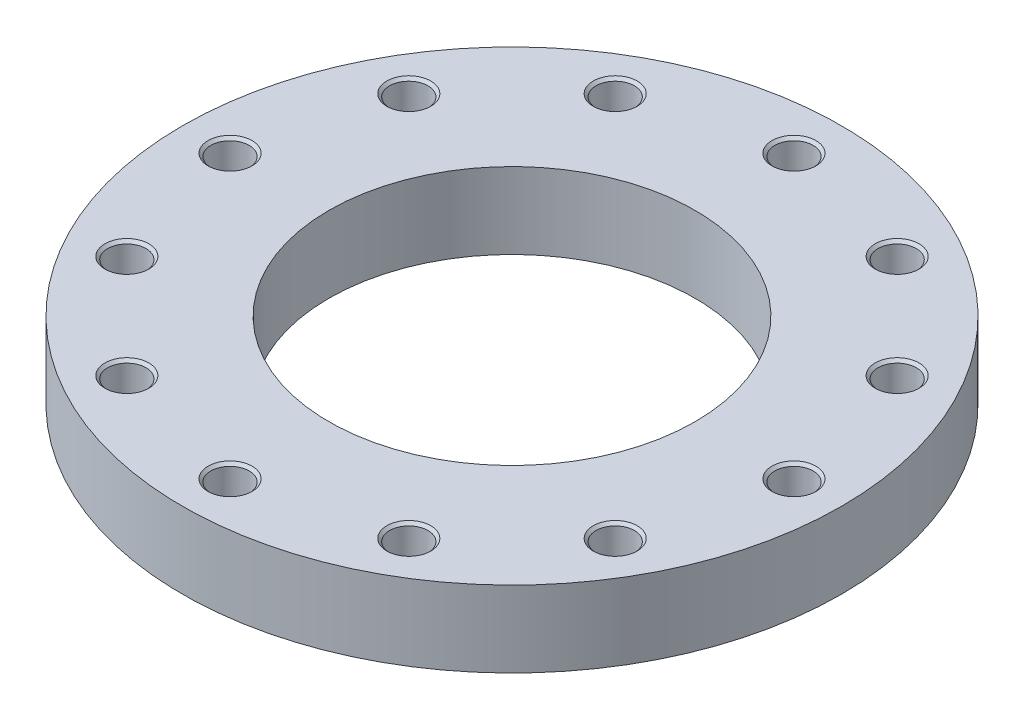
ISO-10303-21;
HEADER;
FILE_DESCRIPTION(('STEP AP214'),'2;1');
FILE_NAME('part.step','',(''),(''),'','','');
FILE_SCHEMA(('AUTOMOTIVE_DESIGN { 1 0 10303 214 1 1 1 1 }'));
ENDSEC;
DATA;
#1=APPLICATION_CONTEXT('core data for automotive mechanical design processes');
#2=APPLICATION_PROTOCOL_DEFINITION('international standard','automotive_design',2000,#1);
#3=PRODUCT_CONTEXT('',#1,'mechanical');
#4=PRODUCT('Part','Part','',(#3));
#5=PRODUCT_RELATED_PRODUCT_CATEGORY('part','',(#4));
#6=PRODUCT_DEFINITION_FORMATION('','',#4);
#7=PRODUCT_DEFINITION_CONTEXT('part definition',#1,'design');
#8=PRODUCT_DEFINITION('design','',#6,#7);
#9=PRODUCT_DEFINITION_SHAPE('','',#8);
#10=(LENGTH_UNIT() NAMED_UNIT(*) SI_UNIT(.MILLI.,.METRE.));
#11=(NAMED_UNIT(*) PLANE_ANGLE_UNIT() SI_UNIT($,.RADIAN.));
#12=(NAMED_UNIT(*) SI_UNIT($,.STERADIAN.) SOLID_ANGLE_UNIT());
#13=UNCERTAINTY_MEASURE_WITH_UNIT(LENGTH_MEASURE(1.E-05),#10,'distance_accuracy_value','');
#14=(GEOMETRIC_REPRESENTATION_CONTEXT(3) GLOBAL_UNCERTAINTY_ASSIGNED_CONTEXT((#13)) GLOBAL_UNIT_ASSIGNED_CONTEXT((#10,
#11,#12)) REPRESENTATION_CONTEXT('',''));
#15=CARTESIAN_POINT('',(0.,0.,0.));
#16=DIRECTION('',(0.,0.,1.));
#17=DIRECTION('',(1.,0.,0.));
#18=AXIS2_PLACEMENT_3D('',#15,#16,#17);
#19=CARTESIAN_POINT('',(0.,26.,0.));
#20=DIRECTION('',(0.,-1.,0.));
#21=DIRECTION('',(1.,0.,0.));
#22=AXIS2_PLACEMENT_3D('',#19,#20,#21);
#23=CYLINDRICAL_SURFACE('',#22,225.);
#24=CARTESIAN_POINT('',(0.,0.,0.));
#25=DIRECTION('',(0.,1.,0.));
#26=DIRECTION('',(1.,0.,0.));
#27=AXIS2_PLACEMENT_3D('',#24,#25,#26);
#28=CIRCLE('',#27,225.);
#29=CARTESIAN_POINT('',(225.,0.,0.));
#30=VERTEX_POINT('',#29);
#31=EDGE_CURVE('E9',#30,#30,#28,.T.);
#32=ORIENTED_EDGE('',*,*,#31,.T.);
#33=EDGE_LOOP('',(#32));
#34=FACE_BOUND('',#33,.T.);
#35=CARTESIAN_POINT('',(0.,52.,0.));
#36=DIRECTION('',(0.,1.,0.));
#37=DIRECTION('',(1.,0.,0.));
#38=AXIS2_PLACEMENT_3D('',#35,#36,#37);
#39=CIRCLE('',#38,225.);
#40=CARTESIAN_POINT('',(225.,52.,0.));
#41=VERTEX_POINT('',#40);
#42=EDGE_CURVE('E170',#41,#41,#39,.T.);
#43=ORIENTED_EDGE('',*,*,#42,.F.);
#44=EDGE_LOOP('',(#43));
#45=FACE_BOUND('',#44,.T.);
#46=ADVANCED_FACE('F15',(#34,#45),#23,.T.);
#47=CARTESIAN_POINT('',(175.,0.,0.));
#48=DIRECTION('',(0.,-1.,0.));
#49=DIRECTION('',(-1.,0.,0.));
#50=AXIS2_PLACEMENT_3D('',#47,#48,#49);
#51=PLANE('',#50);
#52=CARTESIAN_POINT('',(0.,0.,0.));
#53=DIRECTION('',(0.,1.,0.));
#54=DIRECTION('',(1.,0.,0.));
#55=AXIS2_PLACEMENT_3D('',#52,#53,#54);
#56=CIRCLE('',#55,125.);
#57=CARTESIAN_POINT('',(125.,0.,0.));
#58=VERTEX_POINT('',#57);
#59=EDGE_CURVE('E24',#58,#58,#56,.T.);
#60=ORIENTED_EDGE('',*,*,#59,.T.);
#61=EDGE_LOOP('',(#60));
#62=FACE_BOUND('',#61,.T.);
#63=ORIENTED_EDGE('',*,*,#31,.F.);
#64=EDGE_LOOP('',(#63));
#65=FACE_BOUND('',#64,.T.);
#66=ADVANCED_FACE('F473',(#62,#65),#51,.T.);
#67=CARTESIAN_POINT('',(0.,26.,0.));
#68=DIRECTION('',(0.,-1.,0.));
#69=DIRECTION('',(1.,0.,0.));
#70=AXIS2_PLACEMENT_3D('',#67,#68,#69);
#71=CYLINDRICAL_SURFACE('',#70,125.);
#72=CARTESIAN_POINT('',(0.,52.,0.));
#73=DIRECTION('',(0.,1.,0.));
#74=DIRECTION('',(1.,0.,0.));
#75=AXIS2_PLACEMENT_3D('',#72,#73,#74);
#76=CIRCLE('',#75,125.);
#77=CARTESIAN_POINT('',(125.,52.,0.));
#78=VERTEX_POINT('',#77);
#79=EDGE_CURVE('E166',#78,#78,#76,.T.);
#80=ORIENTED_EDGE('',*,*,#79,.T.);
#81=EDGE_LOOP('',(#80));
#82=FACE_BOUND('',#81,.T.);
#83=ORIENTED_EDGE('',*,*,#59,.F.);
#84=EDGE_LOOP('',(#83));
#85=FACE_BOUND('',#84,.T.);
#86=ADVANCED_FACE('F167',(#82,#85),#71,.F.);
#87=CARTESIAN_POINT('',(175.,52.,0.));
#88=DIRECTION('',(0.,1.,0.));
#89=DIRECTION('',(1.,0.,0.));
#90=AXIS2_PLACEMENT_3D('',#87,#88,#89);
#91=PLANE('',#90);
#92=ORIENTED_EDGE('',*,*,#42,.T.);
#93=EDGE_LOOP('',(#92));
#94=FACE_BOUND('',#93,.T.);
#95=ORIENTED_EDGE('',*,*,#79,.F.);
#96=EDGE_LOOP('',(#95));
#97=FACE_BOUND('',#96,.T.);
#98=CARTESIAN_POINT('',(192.5,52.,0.));
#99=DIRECTION('',(0.,-1.,0.));
#100=DIRECTION('',(1.,0.,0.));
#101=AXIS2_PLACEMENT_3D('',#98,#99,#100);
#102=CIRCLE('',#101,15.);
#103=CARTESIAN_POINT('',(207.5,52.,0.));
#104=VERTEX_POINT('',#103);
#105=EDGE_CURVE('E179',#104,#104,#102,.T.);
#106=ORIENTED_EDGE('',*,*,#105,.T.);
#107=EDGE_LOOP('',(#106));
#108=FACE_BOUND('',#107,.T.);
#109=CARTESIAN_POINT('',(166.709890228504,52.,-96.25));
#110=DIRECTION('',(0.,-1.,0.));
#111=DIRECTION('',(0.866025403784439,0.,-0.5));
#112=AXIS2_PLACEMENT_3D('',#109,#110,#111);
#113=CIRCLE('',#112,15.);
#114=CARTESIAN_POINT('',(179.700271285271,52.,-103.75));
#115=VERTEX_POINT('',#114);
#116=EDGE_CURVE('E191',#115,#115,#113,.T.);
#117=ORIENTED_EDGE('',*,*,#116,.T.);
#118=EDGE_LOOP('',(#117));
#119=FACE_BOUND('',#118,.T.);
#120=CARTESIAN_POINT('',(96.25,52.,-166.709890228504));
#121=DIRECTION('',(0.,-1.,0.));
#122=DIRECTION('',(0.5,0.,-0.866025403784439));
#123=AXIS2_PLACEMENT_3D('',#120,#121,#122);
#124=CIRCLE('',#123,15.);
#125=CARTESIAN_POINT('',(103.75,52.,-179.700271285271));
#126=VERTEX_POINT('',#125);
#127=EDGE_CURVE('E200',#126,#126,#124,.T.);
#128=ORIENTED_EDGE('',*,*,#127,.T.);
#129=EDGE_LOOP('',(#128));
#130=FACE_BOUND('',#129,.T.);
#131=CARTESIAN_POINT('',(0.,52.,-192.5));
#132=DIRECTION('',(0.,-1.,0.));
#133=DIRECTION('',(0.,0.,-1.));
#134=AXIS2_PLACEMENT_3D('',#131,#132,#133);
#135=CIRCLE('',#134,15.);
#136=CARTESIAN_POINT('',(0.,52.,-207.5));
#137=VERTEX_POINT('',#136);
#138=EDGE_CURVE('E212',#137,#137,#135,.T.);
#139=ORIENTED_EDGE('',*,*,#138,.T.);
#140=EDGE_LOOP('',(#139));
#141=FACE_BOUND('',#140,.T.);
#142=CARTESIAN_POINT('',(-96.25,52.,-166.709890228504));
#143=DIRECTION('',(0.,-1.,0.));
#144=DIRECTION('',(-0.5,0.,-0.866025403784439));
#145=AXIS2_PLACEMENT_3D('',#142,#143,#144);
#146=CIRCLE('',#145,15.);
#147=CARTESIAN_POINT('',(-103.75,52.,-179.700271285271));
#148=VERTEX_POINT('',#147);
#149=EDGE_CURVE('E226',#148,#148,#146,.T.);
#150=ORIENTED_EDGE('',*,*,#149,.T.);
#151=EDGE_LOOP('',(#150));
#152=FACE_BOUND('',#151,.T.);
#153=CARTESIAN_POINT('',(-166.709890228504,52.,-96.25));
#154=DIRECTION('',(0.,-1.,0.));
#155=DIRECTION('',(-0.866025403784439,0.,-0.5));
#156=AXIS2_PLACEMENT_3D('',#153,#154,#155);
#157=CIRCLE('',#156,15.);
#158=CARTESIAN_POINT('',(-179.700271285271,52.,-103.75));
#159=VERTEX_POINT('',#158);
#160=EDGE_CURVE('E238',#159,#159,#157,.T.);
#161=ORIENTED_EDGE('',*,*,#160,.T.);
#162=EDGE_LOOP('',(#161));
#163=FACE_BOUND('',#162,.T.);
#164=CARTESIAN_POINT('',(-192.5,52.,0.));
#165=DIRECTION('',(0.,-1.,0.));
#166=DIRECTION('',(-1.,0.,0.));
#167=AXIS2_PLACEMENT_3D('',#164,#165,#166);
#168=CIRCLE('',#167,15.);
#169=CARTESIAN_POINT('',(-207.5,52.,0.));
#170=VERTEX_POINT('',#169);
#171=EDGE_CURVE('E252',#170,#170,#168,.T.);
#172=ORIENTED_EDGE('',*,*,#171,.T.);
#173=EDGE_LOOP('',(#172));
#174=FACE_BOUND('',#173,.T.);
#175=CARTESIAN_POINT('',(-166.709890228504,52.,96.25));
#176=DIRECTION('',(0.,-1.,0.));
#177=DIRECTION('',(-0.866025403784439,0.,0.5));
#178=AXIS2_PLACEMENT_3D('',#175,#176,#177);
#179=CIRCLE('',#178,15.);
#180=CARTESIAN_POINT('',(-179.700271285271,52.,103.75));
#181=VERTEX_POINT('',#180);
#182=EDGE_CURVE('E272',#181,#181,#179,.T.);
#183=ORIENTED_EDGE('',*,*,#182,.T.);
#184=EDGE_LOOP('',(#183));
#185=FACE_BOUND('',#184,.T.);
#186=CARTESIAN_POINT('',(-96.25,52.,166.709890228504));
#187=DIRECTION('',(0.,-1.,0.));
#188=DIRECTION('',(-0.5,0.,0.866025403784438));
#189=AXIS2_PLACEMENT_3D('',#186,#187,#188);
#190=CIRCLE('',#189,15.);
#191=CARTESIAN_POINT('',(-103.75,52.,179.700271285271));
#192=VERTEX_POINT('',#191);
#193=EDGE_CURVE('E291',#192,#192,#190,.T.);
#194=ORIENTED_EDGE('',*,*,#193,.T.);
#195=EDGE_LOOP('',(#194));
#196=FACE_BOUND('',#195,.T.);
#197=CARTESIAN_POINT('',(0.,52.,192.5));
#198=DIRECTION('',(0.,-1.,0.));
#199=DIRECTION('',(0.,0.,1.));
#200=AXIS2_PLACEMENT_3D('',#197,#198,#199);
#201=CIRCLE('',#200,15.);
#202=CARTESIAN_POINT('',(0.,52.,207.5));
#203=VERTEX_POINT('',#202);
#204=EDGE_CURVE('E310',#203,#203,#201,.T.);
#205=ORIENTED_EDGE('',*,*,#204,.T.);
#206=EDGE_LOOP('',(#205));
#207=FACE_BOUND('',#206,.T.);
#208=CARTESIAN_POINT('',(96.25,52.,166.709890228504));
#209=DIRECTION('',(0.,-1.,0.));
#210=DIRECTION('',(0.5,0.,0.866025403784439));
#211=AXIS2_PLACEMENT_3D('',#208,#209,#210);
#212=CIRCLE('',#211,15.);
#213=CARTESIAN_POINT('',(103.75,52.,179.700271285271));
#214=VERTEX_POINT('',#213);
#215=EDGE_CURVE('E318',#214,#214,#212,.T.);
#216=ORIENTED_EDGE('',*,*,#215,.T.);
#217=EDGE_LOOP('',(#216));
#218=FACE_BOUND('',#217,.T.);
#219=CARTESIAN_POINT('',(166.709890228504,52.,96.25));
#220=DIRECTION('',(0.,-1.,0.));
#221=DIRECTION('',(0.866025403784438,0.,0.5));
#222=AXIS2_PLACEMENT_3D('',#219,#220,#221);
#223=CIRCLE('',#222,15.);
#224=CARTESIAN_POINT('',(179.700271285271,52.,103.75));
#225=VERTEX_POINT('',#224);
#226=EDGE_CURVE('E346',#225,#225,#223,.T.);
#227=ORIENTED_EDGE('',*,*,#226,.T.);
#228=EDGE_LOOP('',(#227));
#229=FACE_BOUND('',#228,.T.);
#230=ADVANCED_FACE('F17',(#94,#97,#108,#119,#130,#141,#152,#163,#174,#185,#196,#207,#218,#229),
#91,.T.);
#231=CARTESIAN_POINT('',(192.5,8.21673193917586,0.));
#232=DIRECTION('',(0.,1.,0.));
#233=DIRECTION('',(1.,0.,0.));
#234=AXIS2_PLACEMENT_3D('',#231,#232,#233);
#235=CONICAL_SURFACE('',#234,6.5528125,1.0471975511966);
#236=CARTESIAN_POINT('',(192.5,12.,0.));
#237=DIRECTION('',(0.,-1.,0.));
#238=DIRECTION('',(1.,0.,0.));
#239=AXIS2_PLACEMENT_3D('',#236,#237,#238);
#240=CIRCLE('',#239,13.105625);
#241=CARTESIAN_POINT('',(205.605625,12.,0.));
#242=VERTEX_POINT('',#241);
#243=EDGE_CURVE('E171',#242,#242,#240,.T.);
#244=ORIENTED_EDGE('',*,*,#243,.F.);
#245=EDGE_LOOP('',(#244));
#246=FACE_BOUND('',#245,.T.);
#247=CARTESIAN_POINT('',(192.5,4.43346387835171,0.));
#248=VERTEX_POINT('',#247);
#249=VERTEX_LOOP('',#248);
#250=FACE_BOUND('',#249,.T.);
#251=ADVANCED_FACE('F597',(#246,#250),#235,.F.);
#252=CARTESIAN_POINT('',(192.5,16.0528125,0.));
#253=DIRECTION('',(0.,1.,0.));
#254=DIRECTION('',(1.,0.,0.));
#255=AXIS2_PLACEMENT_3D('',#252,#253,#254);
#256=CYLINDRICAL_SURFACE('',#255,13.105625);
#257=CARTESIAN_POINT('',(192.5,20.105625,0.));
#258=DIRECTION('',(0.,-1.,0.));
#259=DIRECTION('',(1.,0.,0.));
#260=AXIS2_PLACEMENT_3D('',#257,#258,#259);
#261=CIRCLE('',#260,13.105625);
#262=CARTESIAN_POINT('',(205.605625,20.105625,0.));
#263=VERTEX_POINT('',#262);
#264=EDGE_CURVE('E173',#263,#263,#261,.T.);
#265=ORIENTED_EDGE('',*,*,#264,.F.);
#266=EDGE_LOOP('',(#265));
#267=FACE_BOUND('',#266,.T.);
#268=ORIENTED_EDGE('',*,*,#243,.T.);
#269=EDGE_LOOP('',(#268));
#270=FACE_BOUND('',#269,.T.);
#271=ADVANCED_FACE('F595',(#267,#270),#256,.F.);
#272=CARTESIAN_POINT('',(192.5,21.0528125,0.));
#273=DIRECTION('',(0.,1.,0.));
#274=DIRECTION('',(1.,0.,0.));
#275=AXIS2_PLACEMENT_3D('',#272,#273,#274);
#276=CONICAL_SURFACE('',#275,14.0528125,0.785398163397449);
#277=CARTESIAN_POINT('',(192.5,22.,0.));
#278=DIRECTION('',(0.,-1.,0.));
#279=DIRECTION('',(1.,0.,0.));
#280=AXIS2_PLACEMENT_3D('',#277,#278,#279);
#281=CIRCLE('',#280,15.);
#282=CARTESIAN_POINT('',(207.5,22.,0.));
#283=VERTEX_POINT('',#282);
#284=EDGE_CURVE('E176',#283,#283,#281,.T.);
#285=ORIENTED_EDGE('',*,*,#284,.F.);
#286=EDGE_LOOP('',(#285));
#287=FACE_BOUND('',#286,.T.);
#288=ORIENTED_EDGE('',*,*,#264,.T.);
#289=EDGE_LOOP('',(#288));
#290=FACE_BOUND('',#289,.T.);
#291=ADVANCED_FACE('F593',(#287,#290),#276,.F.);
#292=CARTESIAN_POINT('',(206.5528125,22.,0.));
#293=DIRECTION('',(0.,1.,0.));
#294=DIRECTION('',(-1.,0.,0.));
#295=AXIS2_PLACEMENT_3D('',#292,#293,#294);
#296=PLANE('',#295);
#297=CARTESIAN_POINT('',(192.5,22.,0.));
#298=DIRECTION('',(0.,-1.,0.));
#299=DIRECTION('',(1.,0.,0.));
#300=AXIS2_PLACEMENT_3D('',#297,#298,#299);
#301=CIRCLE('',#300,13.105625);
#302=CARTESIAN_POINT('',(205.605625,22.,0.));
#303=VERTEX_POINT('',#302);
#304=EDGE_CURVE('E178',#303,#303,#301,.T.);
#305=ORIENTED_EDGE('',*,*,#304,.F.);
#306=EDGE_LOOP('',(#305));
#307=FACE_BOUND('',#306,.T.);
#308=ORIENTED_EDGE('',*,*,#284,.T.);
#309=EDGE_LOOP('',(#308));
#310=FACE_BOUND('',#309,.T.);
#311=ADVANCED_FACE('F590',(#307,#310),#296,.F.);
#312=CARTESIAN_POINT('',(192.5,36.0528125,0.));
#313=DIRECTION('',(0.,1.,0.));
#314=DIRECTION('',(1.,0.,0.));
#315=AXIS2_PLACEMENT_3D('',#312,#313,#314);
#316=CYLINDRICAL_SURFACE('',#315,13.105625);
#317=CARTESIAN_POINT('',(192.5,50.105625,0.));
#318=DIRECTION('',(0.,-1.,0.));
#319=DIRECTION('',(1.,0.,0.));
#320=AXIS2_PLACEMENT_3D('',#317,#318,#319);
#321=CIRCLE('',#320,13.105625);
#322=CARTESIAN_POINT('',(205.605625,50.105625,0.));
#323=VERTEX_POINT('',#322);
#324=EDGE_CURVE('E181',#323,#323,#321,.T.);
#325=ORIENTED_EDGE('',*,*,#324,.F.);
#326=EDGE_LOOP('',(#325));
#327=FACE_BOUND('',#326,.T.);
#328=ORIENTED_EDGE('',*,*,#304,.T.);
#329=EDGE_LOOP('',(#328));
#330=FACE_BOUND('',#329,.T.);
#331=ADVANCED_FACE('F586',(#327,#330),#316,.F.);
#332=CARTESIAN_POINT('',(192.5,51.0528125,0.));
#333=DIRECTION('',(0.,1.,0.));
#334=DIRECTION('',(1.,0.,0.));
#335=AXIS2_PLACEMENT_3D('',#332,#333,#334);
#336=CONICAL_SURFACE('',#335,14.0528125,0.785398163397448);
#337=ORIENTED_EDGE('',*,*,#105,.F.);
#338=EDGE_LOOP('',(#337));
#339=FACE_BOUND('',#338,.T.);
#340=ORIENTED_EDGE('',*,*,#324,.T.);
#341=EDGE_LOOP('',(#340));
#342=FACE_BOUND('',#341,.T.);
#343=ADVANCED_FACE('F582',(#339,#342),#336,.F.);
#344=CARTESIAN_POINT('',(166.709890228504,8.21673193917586,-96.25));
#345=DIRECTION('',(0.,1.,0.));
#346=DIRECTION('',(0.866025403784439,0.,-0.5));
#347=AXIS2_PLACEMENT_3D('',#344,#345,#346);
#348=CONICAL_SURFACE('',#347,6.5528125,1.0471975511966);
#349=CARTESIAN_POINT('',(166.709890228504,12.,-96.25));
#350=DIRECTION('',(0.,-1.,0.));
#351=DIRECTION('',(0.866025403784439,0.,-0.5));
#352=AXIS2_PLACEMENT_3D('',#349,#350,#351);
#353=CIRCLE('',#352,13.105625);
#354=CARTESIAN_POINT('',(178.059694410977,12.,-102.8028125));
#355=VERTEX_POINT('',#354);
#356=EDGE_CURVE('E183',#355,#355,#353,.T.);
#357=ORIENTED_EDGE('',*,*,#356,.F.);
#358=EDGE_LOOP('',(#357));
#359=FACE_BOUND('',#358,.T.);
#360=CARTESIAN_POINT('',(166.709890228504,4.43346387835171,-96.25));
#361=VERTEX_POINT('',#360);
#362=VERTEX_LOOP('',#361);
#363=FACE_BOUND('',#362,.T.);
#364=ADVANCED_FACE('F578',(#359,#363),#348,.F.);
#365=CARTESIAN_POINT('',(166.709890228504,16.0528125,-96.25));
#366=DIRECTION('',(0.,1.,0.));
#367=DIRECTION('',(0.866025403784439,0.,-0.5));
#368=AXIS2_PLACEMENT_3D('',#365,#366,#367);
#369=CYLINDRICAL_SURFACE('',#368,13.105625);
#370=CARTESIAN_POINT('',(166.709890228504,20.105625,-96.25));
#371=DIRECTION('',(0.,-1.,0.));
#372=DIRECTION('',(0.866025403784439,0.,-0.5));
#373=AXIS2_PLACEMENT_3D('',#370,#371,#372);
#374=CIRCLE('',#373,13.105625);
#375=CARTESIAN_POINT('',(178.059694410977,20.105625,-102.8028125));
#376=VERTEX_POINT('',#375);
#377=EDGE_CURVE('E185',#376,#376,#374,.T.);
#378=ORIENTED_EDGE('',*,*,#377,.F.);
#379=EDGE_LOOP('',(#378));
#380=FACE_BOUND('',#379,.T.);
#381=ORIENTED_EDGE('',*,*,#356,.T.);
#382=EDGE_LOOP('',(#381));
#383=FACE_BOUND('',#382,.T.);
#384=ADVANCED_FACE('F574',(#380,#383),#369,.F.);
#385=CARTESIAN_POINT('',(166.709890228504,21.0528125,-96.25));
#386=DIRECTION('',(0.,1.,0.));
#387=DIRECTION('',(0.866025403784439,0.,-0.5));
#388=AXIS2_PLACEMENT_3D('',#385,#386,#387);
#389=CONICAL_SURFACE('',#388,14.0528125,0.785398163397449);
#390=CARTESIAN_POINT('',(166.709890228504,22.,-96.25));
#391=DIRECTION('',(0.,-1.,0.));
#392=DIRECTION('',(0.866025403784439,0.,-0.5));
#393=AXIS2_PLACEMENT_3D('',#390,#391,#392);
#394=CIRCLE('',#393,15.);
#395=CARTESIAN_POINT('',(179.700271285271,22.,-103.75));
#396=VERTEX_POINT('',#395);
#397=EDGE_CURVE('E187',#396,#396,#394,.T.);
#398=ORIENTED_EDGE('',*,*,#397,.F.);
#399=EDGE_LOOP('',(#398));
#400=FACE_BOUND('',#399,.T.);
#401=ORIENTED_EDGE('',*,*,#377,.T.);
#402=EDGE_LOOP('',(#401));
#403=FACE_BOUND('',#402,.T.);
#404=ADVANCED_FACE('F571',(#400,#403),#389,.F.);
#405=CARTESIAN_POINT('',(178.879982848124,22.,-103.27640625));
#406=DIRECTION('',(0.,1.,0.));
#407=DIRECTION('',(-0.866025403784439,0.,0.5));
#408=AXIS2_PLACEMENT_3D('',#405,#406,#407);
#409=PLANE('',#408);
#410=CARTESIAN_POINT('',(166.709890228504,22.,-96.25));
#411=DIRECTION('',(0.,-1.,0.));
#412=DIRECTION('',(0.866025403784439,0.,-0.5));
#413=AXIS2_PLACEMENT_3D('',#410,#411,#412);
#414=CIRCLE('',#413,13.105625);
#415=CARTESIAN_POINT('',(178.059694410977,22.,-102.8028125));
#416=VERTEX_POINT('',#415);
#417=EDGE_CURVE('E189',#416,#416,#414,.T.);
#418=ORIENTED_EDGE('',*,*,#417,.F.);
#419=EDGE_LOOP('',(#418));
#420=FACE_BOUND('',#419,.T.);
#421=ORIENTED_EDGE('',*,*,#397,.T.);
#422=EDGE_LOOP('',(#421));
#423=FACE_BOUND('',#422,.T.);
#424=ADVANCED_FACE('F569',(#420,#423),#409,.F.);
#425=CARTESIAN_POINT('',(166.709890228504,36.0528125,-96.25));
#426=DIRECTION('',(0.,1.,0.));
#427=DIRECTION('',(0.866025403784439,0.,-0.5));
#428=AXIS2_PLACEMENT_3D('',#425,#426,#427);
#429=CYLINDRICAL_SURFACE('',#428,13.105625);
#430=CARTESIAN_POINT('',(166.709890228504,50.105625,-96.25));
#431=DIRECTION('',(0.,-1.,0.));
#432=DIRECTION('',(0.866025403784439,0.,-0.5));
#433=AXIS2_PLACEMENT_3D('',#430,#431,#432);
#434=CIRCLE('',#433,13.105625);
#435=CARTESIAN_POINT('',(178.059694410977,50.105625,-102.8028125));
#436=VERTEX_POINT('',#435);
#437=EDGE_CURVE('E192',#436,#436,#434,.T.);
#438=ORIENTED_EDGE('',*,*,#437,.F.);
#439=EDGE_LOOP('',(#438));
#440=FACE_BOUND('',#439,.T.);
#441=ORIENTED_EDGE('',*,*,#417,.T.);
#442=EDGE_LOOP('',(#441));
#443=FACE_BOUND('',#442,.T.);
#444=ADVANCED_FACE('F565',(#440,#443),#429,.F.);
#445=CARTESIAN_POINT('',(166.709890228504,51.0528125,-96.25));
#446=DIRECTION('',(0.,1.,0.));
#447=DIRECTION('',(0.866025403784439,0.,-0.5));
#448=AXIS2_PLACEMENT_3D('',#445,#446,#447);
#449=CONICAL_SURFACE('',#448,14.0528125,0.785398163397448);
#450=ORIENTED_EDGE('',*,*,#116,.F.);
#451=EDGE_LOOP('',(#450));
#452=FACE_BOUND('',#451,.T.);
#453=ORIENTED_EDGE('',*,*,#437,.T.);
#454=EDGE_LOOP('',(#453));
#455=FACE_BOUND('',#454,.T.);
#456=ADVANCED_FACE('F561',(#452,#455),#449,.F.);
#457=CARTESIAN_POINT('',(96.25,8.21673193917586,-166.709890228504));
#458=DIRECTION('',(0.,1.,0.));
#459=DIRECTION('',(0.5,0.,-0.866025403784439));
#460=AXIS2_PLACEMENT_3D('',#457,#458,#459);
#461=CONICAL_SURFACE('',#460,6.5528125,1.0471975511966);
#462=CARTESIAN_POINT('',(96.25,12.,-166.709890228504));
#463=DIRECTION('',(0.,-1.,0.));
#464=DIRECTION('',(0.5,0.,-0.866025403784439));
#465=AXIS2_PLACEMENT_3D('',#462,#463,#464);
#466=CIRCLE('',#465,13.105625);
#467=CARTESIAN_POINT('',(102.8028125,12.,-178.059694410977));
#468=VERTEX_POINT('',#467);
#469=EDGE_CURVE('E194',#468,#468,#466,.T.);
#470=ORIENTED_EDGE('',*,*,#469,.F.);
#471=EDGE_LOOP('',(#470));
#472=FACE_BOUND('',#471,.T.);
#473=CARTESIAN_POINT('',(96.25,4.43346387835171,-166.709890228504));
#474=VERTEX_POINT('',#473);
#475=VERTEX_LOOP('',#474);
#476=FACE_BOUND('',#475,.T.);
#477=ADVANCED_FACE('F557',(#472,#476),#461,.F.);
#478=CARTESIAN_POINT('',(96.25,16.0528125,-166.709890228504));
#479=DIRECTION('',(0.,1.,0.));
#480=DIRECTION('',(0.5,0.,-0.866025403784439));
#481=AXIS2_PLACEMENT_3D('',#478,#479,#480);
#482=CYLINDRICAL_SURFACE('',#481,13.105625);
#483=CARTESIAN_POINT('',(96.25,20.105625,-166.709890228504));
#484=DIRECTION('',(0.,-1.,0.));
#485=DIRECTION('',(0.5,0.,-0.866025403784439));
#486=AXIS2_PLACEMENT_3D('',#483,#484,#485);
#487=CIRCLE('',#486,13.105625);
#488=CARTESIAN_POINT('',(102.8028125,20.105625,-178.059694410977));
#489=VERTEX_POINT('',#488);
#490=EDGE_CURVE('E196',#489,#489,#487,.T.);
#491=ORIENTED_EDGE('',*,*,#490,.F.);
#492=EDGE_LOOP('',(#491));
#493=FACE_BOUND('',#492,.T.);
#494=ORIENTED_EDGE('',*,*,#469,.T.);
#495=EDGE_LOOP('',(#494));
#496=FACE_BOUND('',#495,.T.);
#497=ADVANCED_FACE('F560',(#493,#496),#482,.F.);
#498=CARTESIAN_POINT('',(96.25,21.0528125,-166.709890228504));
#499=DIRECTION('',(0.,1.,0.));
#500=DIRECTION('',(0.5,0.,-0.866025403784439));
#501=AXIS2_PLACEMENT_3D('',#498,#499,#500);
#502=CONICAL_SURFACE('',#501,14.0528125,0.785398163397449);
#503=CARTESIAN_POINT('',(96.25,22.,-166.709890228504));
#504=DIRECTION('',(0.,-1.,0.));
#505=DIRECTION('',(0.5,0.,-0.866025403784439));
#506=AXIS2_PLACEMENT_3D('',#503,#504,#505);
#507=CIRCLE('',#506,15.);
#508=CARTESIAN_POINT('',(103.75,22.,-179.700271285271));
#509=VERTEX_POINT('',#508);
#510=EDGE_CURVE('E197',#509,#509,#507,.T.);
#511=ORIENTED_EDGE('',*,*,#510,.F.);
#512=EDGE_LOOP('',(#511));
#513=FACE_BOUND('',#512,.T.);
#514=ORIENTED_EDGE('',*,*,#490,.T.);
#515=EDGE_LOOP('',(#514));
#516=FACE_BOUND('',#515,.T.);
#517=ADVANCED_FACE('F555',(#513,#516),#502,.F.);
#518=CARTESIAN_POINT('',(103.27640625,22.,-178.879982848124));
#519=DIRECTION('',(0.,1.,0.));
#520=DIRECTION('',(-0.5,0.,0.866025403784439));
#521=AXIS2_PLACEMENT_3D('',#518,#519,#520);
#522=PLANE('',#521);
#523=CARTESIAN_POINT('',(96.25,22.,-166.709890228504));
#524=DIRECTION('',(0.,-1.,0.));
#525=DIRECTION('',(0.5,0.,-0.866025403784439));
#526=AXIS2_PLACEMENT_3D('',#523,#524,#525);
#527=CIRCLE('',#526,13.105625);
#528=CARTESIAN_POINT('',(102.8028125,22.,-178.059694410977));
#529=VERTEX_POINT('',#528);
#530=EDGE_CURVE('E198',#529,#529,#527,.T.);
#531=ORIENTED_EDGE('',*,*,#530,.F.);
#532=EDGE_LOOP('',(#531));
#533=FACE_BOUND('',#532,.T.);
#534=ORIENTED_EDGE('',*,*,#510,.T.);
#535=EDGE_LOOP('',(#534));
#536=FACE_BOUND('',#535,.T.);
#537=ADVANCED_FACE('F551',(#533,#536),#522,.F.);
#538=CARTESIAN_POINT('',(96.25,36.0528125,-166.709890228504));
#539=DIRECTION('',(0.,1.,0.));
#540=DIRECTION('',(0.5,0.,-0.866025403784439));
#541=AXIS2_PLACEMENT_3D('',#538,#539,#540);
#542=CYLINDRICAL_SURFACE('',#541,13.105625);
#543=CARTESIAN_POINT('',(96.25,50.105625,-166.709890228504));
#544=DIRECTION('',(0.,-1.,0.));
#545=DIRECTION('',(0.5,0.,-0.866025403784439));
#546=AXIS2_PLACEMENT_3D('',#543,#544,#545);
#547=CIRCLE('',#546,13.105625);
#548=CARTESIAN_POINT('',(102.8028125,50.105625,-178.059694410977));
#549=VERTEX_POINT('',#548);
#550=EDGE_CURVE('E203',#549,#549,#547,.T.);
#551=ORIENTED_EDGE('',*,*,#550,.F.);
#552=EDGE_LOOP('',(#551));
#553=FACE_BOUND('',#552,.T.);
#554=ORIENTED_EDGE('',*,*,#530,.T.);
#555=EDGE_LOOP('',(#554));
#556=FACE_BOUND('',#555,.T.);
#557=ADVANCED_FACE('F545',(#553,#556),#542,.F.);
#558=CARTESIAN_POINT('',(96.25,51.0528125,-166.709890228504));
#559=DIRECTION('',(0.,1.,0.));
#560=DIRECTION('',(0.5,0.,-0.866025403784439));
#561=AXIS2_PLACEMENT_3D('',#558,#559,#560);
#562=CONICAL_SURFACE('',#561,14.0528125,0.785398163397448);
#563=ORIENTED_EDGE('',*,*,#127,.F.);
#564=EDGE_LOOP('',(#563));
#565=FACE_BOUND('',#564,.T.);
#566=ORIENTED_EDGE('',*,*,#550,.T.);
#567=EDGE_LOOP('',(#566));
#568=FACE_BOUND('',#567,.T.);
#569=ADVANCED_FACE('F540',(#565,#568),#562,.F.);
#570=CARTESIAN_POINT('',(0.,8.21673193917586,-192.5));
#571=DIRECTION('',(0.,1.,0.));
#572=DIRECTION('',(0.,0.,-1.));
#573=AXIS2_PLACEMENT_3D('',#570,#571,#572);
#574=CONICAL_SURFACE('',#573,6.5528125,1.0471975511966);
#575=CARTESIAN_POINT('',(0.,12.,-192.5));
#576=DIRECTION('',(0.,-1.,0.));
#577=DIRECTION('',(0.,0.,-1.));
#578=AXIS2_PLACEMENT_3D('',#575,#576,#577);
#579=CIRCLE('',#578,13.105625);
#580=CARTESIAN_POINT('',(0.,12.,-205.605625));
#581=VERTEX_POINT('',#580);
#582=EDGE_CURVE('E205',#581,#581,#579,.T.);
#583=ORIENTED_EDGE('',*,*,#582,.F.);
#584=EDGE_LOOP('',(#583));
#585=FACE_BOUND('',#584,.T.);
#586=CARTESIAN_POINT('',(0.,4.43346387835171,-192.5));
#587=VERTEX_POINT('',#586);
#588=VERTEX_LOOP('',#587);
#589=FACE_BOUND('',#588,.T.);
#590=ADVANCED_FACE('F529',(#585,#589),#574,.F.);
#591=CARTESIAN_POINT('',(0.,16.0528125,-192.5));
#592=DIRECTION('',(0.,1.,0.));
#593=DIRECTION('',(0.,0.,-1.));
#594=AXIS2_PLACEMENT_3D('',#591,#592,#593);
#595=CYLINDRICAL_SURFACE('',#594,13.105625);
#596=CARTESIAN_POINT('',(0.,20.105625,-192.5));
#597=DIRECTION('',(0.,-1.,0.));
#598=DIRECTION('',(0.,0.,-1.));
#599=AXIS2_PLACEMENT_3D('',#596,#597,#598);
#600=CIRCLE('',#599,13.105625);
#601=CARTESIAN_POINT('',(0.,20.105625,-205.605625));
#602=VERTEX_POINT('',#601);
#603=EDGE_CURVE('E207',#602,#602,#600,.T.);
#604=ORIENTED_EDGE('',*,*,#603,.F.);
#605=EDGE_LOOP('',(#604));
#606=FACE_BOUND('',#605,.T.);
#607=ORIENTED_EDGE('',*,*,#582,.T.);
#608=EDGE_LOOP('',(#607));
#609=FACE_BOUND('',#608,.T.);
#610=ADVANCED_FACE('F520',(#606,#609),#595,.F.);
#611=CARTESIAN_POINT('',(0.,21.0528125,-192.5));
#612=DIRECTION('',(0.,1.,0.));
#613=DIRECTION('',(0.,0.,-1.));
#614=AXIS2_PLACEMENT_3D('',#611,#612,#613);
#615=CONICAL_SURFACE('',#614,14.0528125,0.785398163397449);
#616=CARTESIAN_POINT('',(0.,22.,-192.5));
#617=DIRECTION('',(0.,-1.,0.));
#618=DIRECTION('',(0.,0.,-1.));
#619=AXIS2_PLACEMENT_3D('',#616,#617,#618);
#620=CIRCLE('',#619,15.);
#621=CARTESIAN_POINT('',(0.,22.,-207.5));
#622=VERTEX_POINT('',#621);
#623=EDGE_CURVE('E208',#622,#622,#620,.T.);
#624=ORIENTED_EDGE('',*,*,#623,.F.);
#625=EDGE_LOOP('',(#624));
#626=FACE_BOUND('',#625,.T.);
#627=ORIENTED_EDGE('',*,*,#603,.T.);
#628=EDGE_LOOP('',(#627));
#629=FACE_BOUND('',#628,.T.);
#630=ADVANCED_FACE('F517',(#626,#629),#615,.F.);
#631=CARTESIAN_POINT('',(0.,22.,-206.5528125));
#632=DIRECTION('',(0.,1.,0.));
#633=DIRECTION('',(0.,0.,1.));
#634=AXIS2_PLACEMENT_3D('',#631,#632,#633);
#635=PLANE('',#634);
#636=CARTESIAN_POINT('',(0.,22.,-192.5));
#637=DIRECTION('',(0.,-1.,0.));
#638=DIRECTION('',(0.,0.,-1.));
#639=AXIS2_PLACEMENT_3D('',#636,#637,#638);
#640=CIRCLE('',#639,13.105625);
#641=CARTESIAN_POINT('',(0.,22.,-205.605625));
#642=VERTEX_POINT('',#641);
#643=EDGE_CURVE('E211',#642,#642,#640,.T.);
#644=ORIENTED_EDGE('',*,*,#643,.F.);
#645=EDGE_LOOP('',(#644));
#646=FACE_BOUND('',#645,.T.);
#647=ORIENTED_EDGE('',*,*,#623,.T.);
#648=EDGE_LOOP('',(#647));
#649=FACE_BOUND('',#648,.T.);
#650=ADVANCED_FACE('F519',(#646,#649),#635,.F.);
#651=CARTESIAN_POINT('',(0.,36.0528125,-192.5));
#652=DIRECTION('',(0.,1.,0.));
#653=DIRECTION('',(0.,0.,-1.));
#654=AXIS2_PLACEMENT_3D('',#651,#652,#653);
#655=CYLINDRICAL_SURFACE('',#654,13.105625);
#656=CARTESIAN_POINT('',(0.,50.105625,-192.5));
#657=DIRECTION('',(0.,-1.,0.));
#658=DIRECTION('',(0.,0.,-1.));
#659=AXIS2_PLACEMENT_3D('',#656,#657,#658);
#660=CIRCLE('',#659,13.105625);
#661=CARTESIAN_POINT('',(0.,50.105625,-205.605625));
#662=VERTEX_POINT('',#661);
#663=EDGE_CURVE('E215',#662,#662,#660,.T.);
#664=ORIENTED_EDGE('',*,*,#663,.F.);
#665=EDGE_LOOP('',(#664));
#666=FACE_BOUND('',#665,.T.);
#667=ORIENTED_EDGE('',*,*,#643,.T.);
#668=EDGE_LOOP('',(#667));
#669=FACE_BOUND('',#668,.T.);
#670=ADVANCED_FACE('F526',(#666,#669),#655,.F.);
#671=CARTESIAN_POINT('',(0.,51.0528125,-192.5));
#672=DIRECTION('',(0.,1.,0.));
#673=DIRECTION('',(0.,0.,-1.));
#674=AXIS2_PLACEMENT_3D('',#671,#672,#673);
#675=CONICAL_SURFACE('',#674,14.0528125,0.785398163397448);
#676=ORIENTED_EDGE('',*,*,#138,.F.);
#677=EDGE_LOOP('',(#676));
#678=FACE_BOUND('',#677,.T.);
#679=ORIENTED_EDGE('',*,*,#663,.T.);
#680=EDGE_LOOP('',(#679));
#681=FACE_BOUND('',#680,.T.);
#682=ADVANCED_FACE('F822',(#678,#681),#675,.F.);
#683=CARTESIAN_POINT('',(-96.25,8.21673193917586,-166.709890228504));
#684=DIRECTION('',(0.,1.,0.));
#685=DIRECTION('',(-0.5,0.,-0.866025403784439));
#686=AXIS2_PLACEMENT_3D('',#683,#684,#685);
#687=CONICAL_SURFACE('',#686,6.5528125,1.0471975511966);
#688=CARTESIAN_POINT('',(-96.25,12.,-166.709890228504));
#689=DIRECTION('',(0.,-1.,0.));
#690=DIRECTION('',(-0.5,0.,-0.866025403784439));
#691=AXIS2_PLACEMENT_3D('',#688,#689,#690);
#692=CIRCLE('',#691,13.105625);
#693=CARTESIAN_POINT('',(-102.8028125,12.,-178.059694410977));
#694=VERTEX_POINT('',#693);
#695=EDGE_CURVE('E217',#694,#694,#692,.T.);
#696=ORIENTED_EDGE('',*,*,#695,.F.);
#697=EDGE_LOOP('',(#696));
#698=FACE_BOUND('',#697,.T.);
#699=CARTESIAN_POINT('',(-96.25,4.43346387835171,-166.709890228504));
#700=VERTEX_POINT('',#699);
#701=VERTEX_LOOP('',#700);
#702=FACE_BOUND('',#701,.T.);
#703=ADVANCED_FACE('F812',(#698,#702),#687,.F.);
#704=CARTESIAN_POINT('',(-96.25,16.0528125,-166.709890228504));
#705=DIRECTION('',(0.,1.,0.));
#706=DIRECTION('',(-0.5,0.,-0.866025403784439));
#707=AXIS2_PLACEMENT_3D('',#704,#705,#706);
#708=CYLINDRICAL_SURFACE('',#707,13.105625);
#709=CARTESIAN_POINT('',(-96.25,20.105625,-166.709890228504));
#710=DIRECTION('',(0.,-1.,0.));
#711=DIRECTION('',(-0.5,0.,-0.866025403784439));
#712=AXIS2_PLACEMENT_3D('',#709,#710,#711);
#713=CIRCLE('',#712,13.105625);
#714=CARTESIAN_POINT('',(-102.8028125,20.105625,-178.059694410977));
#715=VERTEX_POINT('',#714);
#716=EDGE_CURVE('E220',#715,#715,#713,.T.);
#717=ORIENTED_EDGE('',*,*,#716,.F.);
#718=EDGE_LOOP('',(#717));
#719=FACE_BOUND('',#718,.T.);
#720=ORIENTED_EDGE('',*,*,#695,.T.);
#721=EDGE_LOOP('',(#720));
#722=FACE_BOUND('',#721,.T.);
#723=ADVANCED_FACE('F802',(#719,#722),#708,.F.);
#724=CARTESIAN_POINT('',(-96.25,21.0528125,-166.709890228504));
#725=DIRECTION('',(0.,1.,0.));
#726=DIRECTION('',(-0.5,0.,-0.866025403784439));
#727=AXIS2_PLACEMENT_3D('',#724,#725,#726);
#728=CONICAL_SURFACE('',#727,14.0528125,0.785398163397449);
#729=CARTESIAN_POINT('',(-96.25,22.,-166.709890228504));
#730=DIRECTION('',(0.,-1.,0.));
#731=DIRECTION('',(-0.5,0.,-0.866025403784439));
#732=AXIS2_PLACEMENT_3D('',#729,#730,#731);
#733=CIRCLE('',#732,15.);
#734=CARTESIAN_POINT('',(-103.75,22.,-179.700271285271));
#735=VERTEX_POINT('',#734);
#736=EDGE_CURVE('E221',#735,#735,#733,.T.);
#737=ORIENTED_EDGE('',*,*,#736,.F.);
#738=EDGE_LOOP('',(#737));
#739=FACE_BOUND('',#738,.T.);
#740=ORIENTED_EDGE('',*,*,#716,.T.);
#741=EDGE_LOOP('',(#740));
#742=FACE_BOUND('',#741,.T.);
#743=ADVANCED_FACE('F792',(#739,#742),#728,.F.);
#744=CARTESIAN_POINT('',(-103.27640625,22.,-178.879982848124));
#745=DIRECTION('',(0.,1.,0.));
#746=DIRECTION('',(0.5,0.,0.866025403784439));
#747=AXIS2_PLACEMENT_3D('',#744,#745,#746);
#748=PLANE('',#747);
#749=CARTESIAN_POINT('',(-96.25,22.,-166.709890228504));
#750=DIRECTION('',(0.,-1.,0.));
#751=DIRECTION('',(-0.5,0.,-0.866025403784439));
#752=AXIS2_PLACEMENT_3D('',#749,#750,#751);
#753=CIRCLE('',#752,13.105625);
#754=CARTESIAN_POINT('',(-102.8028125,22.,-178.059694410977));
#755=VERTEX_POINT('',#754);
#756=EDGE_CURVE('E224',#755,#755,#753,.T.);
#757=ORIENTED_EDGE('',*,*,#756,.F.);
#758=EDGE_LOOP('',(#757));
#759=FACE_BOUND('',#758,.T.);
#760=ORIENTED_EDGE('',*,*,#736,.T.);
#761=EDGE_LOOP('',(#760));
#762=FACE_BOUND('',#761,.T.);
#763=ADVANCED_FACE('F782',(#759,#762),#748,.F.);
#764=CARTESIAN_POINT('',(-96.25,36.0528125,-166.709890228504));
#765=DIRECTION('',(0.,1.,0.));
#766=DIRECTION('',(-0.5,0.,-0.866025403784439));
#767=AXIS2_PLACEMENT_3D('',#764,#765,#766);
#768=CYLINDRICAL_SURFACE('',#767,13.105625);
#769=CARTESIAN_POINT('',(-96.25,50.105625,-166.709890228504));
#770=DIRECTION('',(0.,-1.,0.));
#771=DIRECTION('',(-0.5,0.,-0.866025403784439));
#772=AXIS2_PLACEMENT_3D('',#769,#770,#771);
#773=CIRCLE('',#772,13.105625);
#774=CARTESIAN_POINT('',(-102.8028125,50.105625,-178.059694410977));
#775=VERTEX_POINT('',#774);
#776=EDGE_CURVE('E228',#775,#775,#773,.T.);
#777=ORIENTED_EDGE('',*,*,#776,.F.);
#778=EDGE_LOOP('',(#777));
#779=FACE_BOUND('',#778,.T.);
#780=ORIENTED_EDGE('',*,*,#756,.T.);
#781=EDGE_LOOP('',(#780));
#782=FACE_BOUND('',#781,.T.);
#783=ADVANCED_FACE('F772',(#779,#782),#768,.F.);
#784=CARTESIAN_POINT('',(-96.25,51.0528125,-166.709890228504));
#785=DIRECTION('',(0.,1.,0.));
#786=DIRECTION('',(-0.5,0.,-0.866025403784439));
#787=AXIS2_PLACEMENT_3D('',#784,#785,#786);
#788=CONICAL_SURFACE('',#787,14.0528125,0.785398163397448);
#789=ORIENTED_EDGE('',*,*,#149,.F.);
#790=EDGE_LOOP('',(#789));
#791=FACE_BOUND('',#790,.T.);
#792=ORIENTED_EDGE('',*,*,#776,.T.);
#793=EDGE_LOOP('',(#792));
#794=FACE_BOUND('',#793,.T.);
#795=ADVANCED_FACE('F762',(#791,#794),#788,.F.);
#796=CARTESIAN_POINT('',(-166.709890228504,8.21673193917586,-96.25));
#797=DIRECTION('',(0.,1.,0.));
#798=DIRECTION('',(-0.866025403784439,0.,-0.5));
#799=AXIS2_PLACEMENT_3D('',#796,#797,#798);
#800=CONICAL_SURFACE('',#799,6.5528125,1.0471975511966);
#801=CARTESIAN_POINT('',(-166.709890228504,12.,-96.25));
#802=DIRECTION('',(0.,-1.,0.));
#803=DIRECTION('',(-0.866025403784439,0.,-0.5));
#804=AXIS2_PLACEMENT_3D('',#801,#802,#803);
#805=CIRCLE('',#804,13.105625);
#806=CARTESIAN_POINT('',(-178.059694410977,12.,-102.8028125));
#807=VERTEX_POINT('',#806);
#808=EDGE_CURVE('E230',#807,#807,#805,.T.);
#809=ORIENTED_EDGE('',*,*,#808,.F.);
#810=EDGE_LOOP('',(#809));
#811=FACE_BOUND('',#810,.T.);
#812=CARTESIAN_POINT('',(-166.709890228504,4.43346387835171,-96.25));
#813=VERTEX_POINT('',#812);
#814=VERTEX_LOOP('',#813);
#815=FACE_BOUND('',#814,.T.);
#816=ADVANCED_FACE('F752',(#811,#815),#800,.F.);
#817=CARTESIAN_POINT('',(-166.709890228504,16.0528125,-96.25));
#818=DIRECTION('',(0.,1.,0.));
#819=DIRECTION('',(-0.866025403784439,0.,-0.5));
#820=AXIS2_PLACEMENT_3D('',#817,#818,#819);
#821=CYLINDRICAL_SURFACE('',#820,13.105625);
#822=CARTESIAN_POINT('',(-166.709890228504,20.105625,-96.25));
#823=DIRECTION('',(0.,-1.,0.));
#824=DIRECTION('',(-0.866025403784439,0.,-0.5));
#825=AXIS2_PLACEMENT_3D('',#822,#823,#824);
#826=CIRCLE('',#825,13.105625);
#827=CARTESIAN_POINT('',(-178.059694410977,20.105625,-102.8028125));
#828=VERTEX_POINT('',#827);
#829=EDGE_CURVE('E232',#828,#828,#826,.T.);
#830=ORIENTED_EDGE('',*,*,#829,.F.);
#831=EDGE_LOOP('',(#830));
#832=FACE_BOUND('',#831,.T.);
#833=ORIENTED_EDGE('',*,*,#808,.T.);
#834=EDGE_LOOP('',(#833));
#835=FACE_BOUND('',#834,.T.);
#836=ADVANCED_FACE('F742',(#832,#835),#821,.F.);
#837=CARTESIAN_POINT('',(-166.709890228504,21.0528125,-96.25));
#838=DIRECTION('',(0.,1.,0.));
#839=DIRECTION('',(-0.866025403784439,0.,-0.5));
#840=AXIS2_PLACEMENT_3D('',#837,#838,#839);
#841=CONICAL_SURFACE('',#840,14.0528125,0.785398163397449);
#842=CARTESIAN_POINT('',(-166.709890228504,22.,-96.25));
#843=DIRECTION('',(0.,-1.,0.));
#844=DIRECTION('',(-0.866025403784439,0.,-0.5));
#845=AXIS2_PLACEMENT_3D('',#842,#843,#844);
#846=CIRCLE('',#845,15.);
#847=CARTESIAN_POINT('',(-179.700271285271,22.,-103.75));
#848=VERTEX_POINT('',#847);
#849=EDGE_CURVE('E235',#848,#848,#846,.T.);
#850=ORIENTED_EDGE('',*,*,#849,.F.);
#851=EDGE_LOOP('',(#850));
#852=FACE_BOUND('',#851,.T.);
#853=ORIENTED_EDGE('',*,*,#829,.T.);
#854=EDGE_LOOP('',(#853));
#855=FACE_BOUND('',#854,.T.);
#856=ADVANCED_FACE('F732',(#852,#855),#841,.F.);
#857=CARTESIAN_POINT('',(-178.879982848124,22.,-103.27640625));
#858=DIRECTION('',(0.,1.,0.));
#859=DIRECTION('',(0.866025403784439,0.,0.5));
#860=AXIS2_PLACEMENT_3D('',#857,#858,#859);
#861=PLANE('',#860);
#862=CARTESIAN_POINT('',(-166.709890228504,22.,-96.25));
#863=DIRECTION('',(0.,-1.,0.));
#864=DIRECTION('',(-0.866025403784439,0.,-0.5));
#865=AXIS2_PLACEMENT_3D('',#862,#863,#864);
#866=CIRCLE('',#865,13.105625);
#867=CARTESIAN_POINT('',(-178.059694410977,22.,-102.8028125));
#868=VERTEX_POINT('',#867);
#869=EDGE_CURVE('E236',#868,#868,#866,.T.);
#870=ORIENTED_EDGE('',*,*,#869,.F.);
#871=EDGE_LOOP('',(#870));
#872=FACE_BOUND('',#871,.T.);
#873=ORIENTED_EDGE('',*,*,#849,.T.);
#874=EDGE_LOOP('',(#873));
#875=FACE_BOUND('',#874,.T.);
#876=ADVANCED_FACE('F722',(#872,#875),#861,.F.);
#877=CARTESIAN_POINT('',(-166.709890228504,36.0528125,-96.25));
#878=DIRECTION('',(0.,1.,0.));
#879=DIRECTION('',(-0.866025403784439,0.,-0.5));
#880=AXIS2_PLACEMENT_3D('',#877,#878,#879);
#881=CYLINDRICAL_SURFACE('',#880,13.105625);
#882=CARTESIAN_POINT('',(-166.709890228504,50.105625,-96.25));
#883=DIRECTION('',(0.,-1.,0.));
#884=DIRECTION('',(-0.866025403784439,0.,-0.5));
#885=AXIS2_PLACEMENT_3D('',#882,#883,#884);
#886=CIRCLE('',#885,13.105625);
#887=CARTESIAN_POINT('',(-178.059694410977,50.105625,-102.8028125));
#888=VERTEX_POINT('',#887);
#889=EDGE_CURVE('E241',#888,#888,#886,.T.);
#890=ORIENTED_EDGE('',*,*,#889,.F.);
#891=EDGE_LOOP('',(#890));
#892=FACE_BOUND('',#891,.T.);
#893=ORIENTED_EDGE('',*,*,#869,.T.);
#894=EDGE_LOOP('',(#893));
#895=FACE_BOUND('',#894,.T.);
#896=ADVANCED_FACE('F469',(#892,#895),#881,.F.);
#897=CARTESIAN_POINT('',(-166.709890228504,51.0528125,-96.25));
#898=DIRECTION('',(0.,1.,0.));
#899=DIRECTION('',(-0.866025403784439,0.,-0.5));
#900=AXIS2_PLACEMENT_3D('',#897,#898,#899);
#901=CONICAL_SURFACE('',#900,14.0528125,0.785398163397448);
#902=ORIENTED_EDGE('',*,*,#160,.F.);
#903=EDGE_LOOP('',(#902));
#904=FACE_BOUND('',#903,.T.);
#905=ORIENTED_EDGE('',*,*,#889,.T.);
#906=EDGE_LOOP('',(#905));
#907=FACE_BOUND('',#906,.T.);
#908=ADVANCED_FACE('F463',(#904,#907),#901,.F.);
#909=CARTESIAN_POINT('',(-192.5,8.21673193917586,0.));
#910=DIRECTION('',(0.,1.,0.));
#911=DIRECTION('',(-1.,0.,0.));
#912=AXIS2_PLACEMENT_3D('',#909,#910,#911);
#913=CONICAL_SURFACE('',#912,6.5528125,1.0471975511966);
#914=CARTESIAN_POINT('',(-192.5,12.,0.));
#915=DIRECTION('',(0.,-1.,0.));
#916=DIRECTION('',(-1.,0.,0.));
#917=AXIS2_PLACEMENT_3D('',#914,#915,#916);
#918=CIRCLE('',#917,13.105625);
#919=CARTESIAN_POINT('',(-205.605625,12.,0.));
#920=VERTEX_POINT('',#919);
#921=EDGE_CURVE('E243',#920,#920,#918,.T.);
#922=ORIENTED_EDGE('',*,*,#921,.F.);
#923=EDGE_LOOP('',(#922));
#924=FACE_BOUND('',#923,.T.);
#925=CARTESIAN_POINT('',(-192.5,4.43346387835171,0.));
#926=VERTEX_POINT('',#925);
#927=VERTEX_LOOP('',#926);
#928=FACE_BOUND('',#927,.T.);
#929=ADVANCED_FACE('F457',(#924,#928),#913,.F.);
#930=CARTESIAN_POINT('',(-192.5,16.0528125,0.));
#931=DIRECTION('',(0.,1.,0.));
#932=DIRECTION('',(-1.,0.,0.));
#933=AXIS2_PLACEMENT_3D('',#930,#931,#932);
#934=CYLINDRICAL_SURFACE('',#933,13.105625);
#935=CARTESIAN_POINT('',(-192.5,20.105625,0.));
#936=DIRECTION('',(0.,-1.,0.));
#937=DIRECTION('',(-1.,0.,0.));
#938=AXIS2_PLACEMENT_3D('',#935,#936,#937);
#939=CIRCLE('',#938,13.105625);
#940=CARTESIAN_POINT('',(-205.605625,20.105625,0.));
#941=VERTEX_POINT('',#940);
#942=EDGE_CURVE('E245',#941,#941,#939,.T.);
#943=ORIENTED_EDGE('',*,*,#942,.F.);
#944=EDGE_LOOP('',(#943));
#945=FACE_BOUND('',#944,.T.);
#946=ORIENTED_EDGE('',*,*,#921,.T.);
#947=EDGE_LOOP('',(#946));
#948=FACE_BOUND('',#947,.T.);
#949=ADVANCED_FACE('F451',(#945,#948),#934,.F.);
#950=CARTESIAN_POINT('',(-192.5,21.0528125,0.));
#951=DIRECTION('',(0.,1.,0.));
#952=DIRECTION('',(-1.,0.,0.));
#953=AXIS2_PLACEMENT_3D('',#950,#951,#952);
#954=CONICAL_SURFACE('',#953,14.0528125,0.785398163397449);
#955=CARTESIAN_POINT('',(-192.5,22.,0.));
#956=DIRECTION('',(0.,-1.,0.));
#957=DIRECTION('',(-1.,0.,0.));
#958=AXIS2_PLACEMENT_3D('',#955,#956,#957);
#959=CIRCLE('',#958,15.);
#960=CARTESIAN_POINT('',(-207.5,22.,0.));
#961=VERTEX_POINT('',#960);
#962=EDGE_CURVE('E247',#961,#961,#959,.T.);
#963=ORIENTED_EDGE('',*,*,#962,.F.);
#964=EDGE_LOOP('',(#963));
#965=FACE_BOUND('',#964,.T.);
#966=ORIENTED_EDGE('',*,*,#942,.T.);
#967=EDGE_LOOP('',(#966));
#968=FACE_BOUND('',#967,.T.);
#969=ADVANCED_FACE('F445',(#965,#968),#954,.F.);
#970=CARTESIAN_POINT('',(-206.5528125,22.,0.));
#971=DIRECTION('',(0.,1.,0.));
#972=DIRECTION('',(1.,0.,0.));
#973=AXIS2_PLACEMENT_3D('',#970,#971,#972);
#974=PLANE('',#973);
#975=CARTESIAN_POINT('',(-192.5,22.,0.));
#976=DIRECTION('',(0.,-1.,0.));
#977=DIRECTION('',(-1.,0.,0.));
#978=AXIS2_PLACEMENT_3D('',#975,#976,#977);
#979=CIRCLE('',#978,13.105625);
#980=CARTESIAN_POINT('',(-205.605625,22.,0.));
#981=VERTEX_POINT('',#980);
#982=EDGE_CURVE('E249',#981,#981,#979,.T.);
#983=ORIENTED_EDGE('',*,*,#982,.F.);
#984=EDGE_LOOP('',(#983));
#985=FACE_BOUND('',#984,.T.);
#986=ORIENTED_EDGE('',*,*,#962,.T.);
#987=EDGE_LOOP('',(#986));
#988=FACE_BOUND('',#987,.T.);
#989=ADVANCED_FACE('F442',(#985,#988),#974,.F.);
#990=CARTESIAN_POINT('',(-192.5,36.0528125,0.));
#991=DIRECTION('',(0.,1.,0.));
#992=DIRECTION('',(-1.,0.,0.));
#993=AXIS2_PLACEMENT_3D('',#990,#991,#992);
#994=CYLINDRICAL_SURFACE('',#993,13.105625);
#995=CARTESIAN_POINT('',(-192.5,50.105625,0.));
#996=DIRECTION('',(0.,-1.,0.));
#997=DIRECTION('',(-1.,0.,0.));
#998=AXIS2_PLACEMENT_3D('',#995,#996,#997);
#999=CIRCLE('',#998,13.105625);
#1000=CARTESIAN_POINT('',(-205.605625,50.105625,0.));
#1001=VERTEX_POINT('',#1000);
#1002=EDGE_CURVE('E255',#1001,#1001,#999,.T.);
#1003=ORIENTED_EDGE('',*,*,#1002,.F.);
#1004=EDGE_LOOP('',(#1003));
#1005=FACE_BOUND('',#1004,.T.);
#1006=ORIENTED_EDGE('',*,*,#982,.T.);
#1007=EDGE_LOOP('',(#1006));
#1008=FACE_BOUND('',#1007,.T.);
#1009=ADVANCED_FACE('F440',(#1005,#1008),#994,.F.);
#1010=CARTESIAN_POINT('',(-192.5,51.0528125,0.));
#1011=DIRECTION('',(0.,1.,0.));
#1012=DIRECTION('',(-1.,0.,0.));
#1013=AXIS2_PLACEMENT_3D('',#1010,#1011,#1012);
#1014=CONICAL_SURFACE('',#1013,14.0528125,0.785398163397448);
#1015=ORIENTED_EDGE('',*,*,#171,.F.);
#1016=EDGE_LOOP('',(#1015));
#1017=FACE_BOUND('',#1016,.T.);
#1018=ORIENTED_EDGE('',*,*,#1002,.T.);
#1019=EDGE_LOOP('',(#1018));
#1020=FACE_BOUND('',#1019,.T.);
#1021=ADVANCED_FACE('F509',(#1017,#1020),#1014,.F.);
#1022=CARTESIAN_POINT('',(-166.709890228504,8.21673193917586,96.25));
#1023=DIRECTION('',(0.,1.,0.));
#1024=DIRECTION('',(-0.866025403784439,0.,0.5));
#1025=AXIS2_PLACEMENT_3D('',#1022,#1023,#1024);
#1026=CONICAL_SURFACE('',#1025,6.5528125,1.0471975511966);
#1027=CARTESIAN_POINT('',(-166.709890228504,12.,96.25));
#1028=DIRECTION('',(0.,-1.,0.));
#1029=DIRECTION('',(-0.866025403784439,0.,0.5));
#1030=AXIS2_PLACEMENT_3D('',#1027,#1028,#1029);
#1031=CIRCLE('',#1030,13.105625);
#1032=CARTESIAN_POINT('',(-178.059694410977,12.,102.8028125));
#1033=VERTEX_POINT('',#1032);
#1034=EDGE_CURVE('E259',#1033,#1033,#1031,.T.);
#1035=ORIENTED_EDGE('',*,*,#1034,.F.);
#1036=EDGE_LOOP('',(#1035));
#1037=FACE_BOUND('',#1036,.T.);
#1038=CARTESIAN_POINT('',(-166.709890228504,4.43346387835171,96.25));
#1039=VERTEX_POINT('',#1038);
#1040=VERTEX_LOOP('',#1039);
#1041=FACE_BOUND('',#1040,.T.);
#1042=ADVANCED_FACE('F505',(#1037,#1041),#1026,.F.);
#1043=CARTESIAN_POINT('',(-166.709890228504,16.0528125,96.25));
#1044=DIRECTION('',(0.,1.,0.));
#1045=DIRECTION('',(-0.866025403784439,0.,0.5));
#1046=AXIS2_PLACEMENT_3D('',#1043,#1044,#1045);
#1047=CYLINDRICAL_SURFACE('',#1046,13.105625);
#1048=CARTESIAN_POINT('',(-166.709890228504,20.105625,96.25));
#1049=DIRECTION('',(0.,-1.,0.));
#1050=DIRECTION('',(-0.866025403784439,0.,0.5));
#1051=AXIS2_PLACEMENT_3D('',#1048,#1049,#1050);
#1052=CIRCLE('',#1051,13.105625);
#1053=CARTESIAN_POINT('',(-178.059694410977,20.105625,102.8028125));
#1054=VERTEX_POINT('',#1053);
#1055=EDGE_CURVE('E262',#1054,#1054,#1052,.T.);
#1056=ORIENTED_EDGE('',*,*,#1055,.F.);
#1057=EDGE_LOOP('',(#1056));
#1058=FACE_BOUND('',#1057,.T.);
#1059=ORIENTED_EDGE('',*,*,#1034,.T.);
#1060=EDGE_LOOP('',(#1059));
#1061=FACE_BOUND('',#1060,.T.);
#1062=ADVANCED_FACE('F501',(#1058,#1061),#1047,.F.);
#1063=CARTESIAN_POINT('',(-166.709890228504,21.0528125,96.25));
#1064=DIRECTION('',(0.,1.,0.));
#1065=DIRECTION('',(-0.866025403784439,0.,0.5));
#1066=AXIS2_PLACEMENT_3D('',#1063,#1064,#1065);
#1067=CONICAL_SURFACE('',#1066,14.0528125,0.785398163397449);
#1068=CARTESIAN_POINT('',(-166.709890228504,22.,96.25));
#1069=DIRECTION('',(0.,-1.,0.));
#1070=DIRECTION('',(-0.866025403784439,0.,0.5));
#1071=AXIS2_PLACEMENT_3D('',#1068,#1069,#1070);
#1072=CIRCLE('',#1071,15.);
#1073=CARTESIAN_POINT('',(-179.700271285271,22.,103.75));
#1074=VERTEX_POINT('',#1073);
#1075=EDGE_CURVE('E265',#1074,#1074,#1072,.T.);
#1076=ORIENTED_EDGE('',*,*,#1075,.F.);
#1077=EDGE_LOOP('',(#1076));
#1078=FACE_BOUND('',#1077,.T.);
#1079=ORIENTED_EDGE('',*,*,#1055,.T.);
#1080=EDGE_LOOP('',(#1079));
#1081=FACE_BOUND('',#1080,.T.);
#1082=ADVANCED_FACE('F497',(#1078,#1081),#1067,.F.);
#1083=CARTESIAN_POINT('',(-178.879982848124,22.,103.27640625));
#1084=DIRECTION('',(0.,1.,0.));
#1085=DIRECTION('',(0.866025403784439,0.,-0.5));
#1086=AXIS2_PLACEMENT_3D('',#1083,#1084,#1085);
#1087=PLANE('',#1086);
#1088=CARTESIAN_POINT('',(-166.709890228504,22.,96.25));
#1089=DIRECTION('',(0.,-1.,0.));
#1090=DIRECTION('',(-0.866025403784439,0.,0.5));
#1091=AXIS2_PLACEMENT_3D('',#1088,#1089,#1090);
#1092=CIRCLE('',#1091,13.105625);
#1093=CARTESIAN_POINT('',(-178.059694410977,22.,102.8028125));
#1094=VERTEX_POINT('',#1093);
#1095=EDGE_CURVE('E269',#1094,#1094,#1092,.T.);
#1096=ORIENTED_EDGE('',*,*,#1095,.F.);
#1097=EDGE_LOOP('',(#1096));
#1098=FACE_BOUND('',#1097,.T.);
#1099=ORIENTED_EDGE('',*,*,#1075,.T.);
#1100=EDGE_LOOP('',(#1099));
#1101=FACE_BOUND('',#1100,.T.);
#1102=ADVANCED_FACE('F493',(#1098,#1101),#1087,.F.);
#1103=CARTESIAN_POINT('',(-166.709890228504,36.0528125,96.25));
#1104=DIRECTION('',(0.,1.,0.));
#1105=DIRECTION('',(-0.866025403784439,0.,0.5));
#1106=AXIS2_PLACEMENT_3D('',#1103,#1104,#1105);
#1107=CYLINDRICAL_SURFACE('',#1106,13.105625);
#1108=CARTESIAN_POINT('',(-166.709890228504,50.105625,96.25));
#1109=DIRECTION('',(0.,-1.,0.));
#1110=DIRECTION('',(-0.866025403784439,0.,0.5));
#1111=AXIS2_PLACEMENT_3D('',#1108,#1109,#1110);
#1112=CIRCLE('',#1111,13.105625);
#1113=CARTESIAN_POINT('',(-178.059694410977,50.105625,102.8028125));
#1114=VERTEX_POINT('',#1113);
#1115=EDGE_CURVE('E275',#1114,#1114,#1112,.T.);
#1116=ORIENTED_EDGE('',*,*,#1115,.F.);
#1117=EDGE_LOOP('',(#1116));
#1118=FACE_BOUND('',#1117,.T.);
#1119=ORIENTED_EDGE('',*,*,#1095,.T.);
#1120=EDGE_LOOP('',(#1119));
#1121=FACE_BOUND('',#1120,.T.);
#1122=ADVANCED_FACE('F490',(#1118,#1121),#1107,.F.);
#1123=CARTESIAN_POINT('',(-166.709890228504,51.0528125,96.25));
#1124=DIRECTION('',(0.,1.,0.));
#1125=DIRECTION('',(-0.866025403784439,0.,0.5));
#1126=AXIS2_PLACEMENT_3D('',#1123,#1124,#1125);
#1127=CONICAL_SURFACE('',#1126,14.0528125,0.785398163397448);
#1128=ORIENTED_EDGE('',*,*,#182,.F.);
#1129=EDGE_LOOP('',(#1128));
#1130=FACE_BOUND('',#1129,.T.);
#1131=ORIENTED_EDGE('',*,*,#1115,.T.);
#1132=EDGE_LOOP('',(#1131));
#1133=FACE_BOUND('',#1132,.T.);
#1134=ADVANCED_FACE('F488',(#1130,#1133),#1127,.F.);
#1135=CARTESIAN_POINT('',(-96.25,8.21673193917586,166.709890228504));
#1136=DIRECTION('',(0.,1.,0.));
#1137=DIRECTION('',(-0.5,0.,0.866025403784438));
#1138=AXIS2_PLACEMENT_3D('',#1135,#1136,#1137);
#1139=CONICAL_SURFACE('',#1138,6.5528125,1.0471975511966);
#1140=CARTESIAN_POINT('',(-96.25,12.,166.709890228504));
#1141=DIRECTION('',(0.,-1.,0.));
#1142=DIRECTION('',(-0.5,0.,0.866025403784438));
#1143=AXIS2_PLACEMENT_3D('',#1140,#1141,#1142);
#1144=CIRCLE('',#1143,13.105625);
#1145=CARTESIAN_POINT('',(-102.8028125,12.,178.059694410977));
#1146=VERTEX_POINT('',#1145);
#1147=EDGE_CURVE('E278',#1146,#1146,#1144,.T.);
#1148=ORIENTED_EDGE('',*,*,#1147,.F.);
#1149=EDGE_LOOP('',(#1148));
#1150=FACE_BOUND('',#1149,.T.);
#1151=CARTESIAN_POINT('',(-96.25,4.43346387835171,166.709890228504));
#1152=VERTEX_POINT('',#1151);
#1153=VERTEX_LOOP('',#1152);
#1154=FACE_BOUND('',#1153,.T.);
#1155=ADVANCED_FACE('F485',(#1150,#1154),#1139,.F.);
#1156=CARTESIAN_POINT('',(-96.25,16.0528125,166.709890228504));
#1157=DIRECTION('',(0.,1.,0.));
#1158=DIRECTION('',(-0.5,0.,0.866025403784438));
#1159=AXIS2_PLACEMENT_3D('',#1156,#1157,#1158);
#1160=CYLINDRICAL_SURFACE('',#1159,13.105625);
#1161=CARTESIAN_POINT('',(-96.25,20.105625,166.709890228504));
#1162=DIRECTION('',(0.,-1.,0.));
#1163=DIRECTION('',(-0.5,0.,0.866025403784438));
#1164=AXIS2_PLACEMENT_3D('',#1161,#1162,#1163);
#1165=CIRCLE('',#1164,13.105625);
#1166=CARTESIAN_POINT('',(-102.8028125,20.105625,178.059694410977));
#1167=VERTEX_POINT('',#1166);
#1168=EDGE_CURVE('E282',#1167,#1167,#1165,.T.);
#1169=ORIENTED_EDGE('',*,*,#1168,.F.);
#1170=EDGE_LOOP('',(#1169));
#1171=FACE_BOUND('',#1170,.T.);
#1172=ORIENTED_EDGE('',*,*,#1147,.T.);
#1173=EDGE_LOOP('',(#1172));
#1174=FACE_BOUND('',#1173,.T.);
#1175=ADVANCED_FACE('F483',(#1171,#1174),#1160,.F.);
#1176=CARTESIAN_POINT('',(-96.25,21.0528125,166.709890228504));
#1177=DIRECTION('',(0.,1.,0.));
#1178=DIRECTION('',(-0.5,0.,0.866025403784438));
#1179=AXIS2_PLACEMENT_3D('',#1176,#1177,#1178);
#1180=CONICAL_SURFACE('',#1179,14.0528125,0.785398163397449);
#1181=CARTESIAN_POINT('',(-96.25,22.,166.709890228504));
#1182=DIRECTION('',(0.,-1.,0.));
#1183=DIRECTION('',(-0.5,0.,0.866025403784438));
#1184=AXIS2_PLACEMENT_3D('',#1181,#1182,#1183);
#1185=CIRCLE('',#1184,15.);
#1186=CARTESIAN_POINT('',(-103.75,22.,179.700271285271));
#1187=VERTEX_POINT('',#1186);
#1188=EDGE_CURVE('E285',#1187,#1187,#1185,.T.);
#1189=ORIENTED_EDGE('',*,*,#1188,.F.);
#1190=EDGE_LOOP('',(#1189));
#1191=FACE_BOUND('',#1190,.T.);
#1192=ORIENTED_EDGE('',*,*,#1168,.T.);
#1193=EDGE_LOOP('',(#1192));
#1194=FACE_BOUND('',#1193,.T.);
#1195=ADVANCED_FACE('F630',(#1191,#1194),#1180,.F.);
#1196=CARTESIAN_POINT('',(-103.27640625,22.,178.879982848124));
#1197=DIRECTION('',(0.,1.,0.));
#1198=DIRECTION('',(0.5,0.,-0.866025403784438));
#1199=AXIS2_PLACEMENT_3D('',#1196,#1197,#1198);
#1200=PLANE('',#1199);
#1201=CARTESIAN_POINT('',(-96.25,22.,166.709890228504));
#1202=DIRECTION('',(0.,-1.,0.));
#1203=DIRECTION('',(-0.5,0.,0.866025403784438));
#1204=AXIS2_PLACEMENT_3D('',#1201,#1202,#1203);
#1205=CIRCLE('',#1204,13.105625);
#1206=CARTESIAN_POINT('',(-102.8028125,22.,178.059694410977));
#1207=VERTEX_POINT('',#1206);
#1208=EDGE_CURVE('E288',#1207,#1207,#1205,.T.);
#1209=ORIENTED_EDGE('',*,*,#1208,.F.);
#1210=EDGE_LOOP('',(#1209));
#1211=FACE_BOUND('',#1210,.T.);
#1212=ORIENTED_EDGE('',*,*,#1188,.T.);
#1213=EDGE_LOOP('',(#1212));
#1214=FACE_BOUND('',#1213,.T.);
#1215=ADVANCED_FACE('F627',(#1211,#1214),#1200,.F.);
#1216=CARTESIAN_POINT('',(-96.25,36.0528125,166.709890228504));
#1217=DIRECTION('',(0.,1.,0.));
#1218=DIRECTION('',(-0.5,0.,0.866025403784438));
#1219=AXIS2_PLACEMENT_3D('',#1216,#1217,#1218);
#1220=CYLINDRICAL_SURFACE('',#1219,13.105625);
#1221=CARTESIAN_POINT('',(-96.25,50.105625,166.709890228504));
#1222=DIRECTION('',(0.,-1.,0.));
#1223=DIRECTION('',(-0.5,0.,0.866025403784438));
#1224=AXIS2_PLACEMENT_3D('',#1221,#1222,#1223);
#1225=CIRCLE('',#1224,13.105625);
#1226=CARTESIAN_POINT('',(-102.8028125,50.105625,178.059694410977));
#1227=VERTEX_POINT('',#1226);
#1228=EDGE_CURVE('E294',#1227,#1227,#1225,.T.);
#1229=ORIENTED_EDGE('',*,*,#1228,.F.);
#1230=EDGE_LOOP('',(#1229));
#1231=FACE_BOUND('',#1230,.T.);
#1232=ORIENTED_EDGE('',*,*,#1208,.T.);
#1233=EDGE_LOOP('',(#1232));
#1234=FACE_BOUND('',#1233,.T.);
#1235=ADVANCED_FACE('F623',(#1231,#1234),#1220,.F.);
#1236=CARTESIAN_POINT('',(-96.25,51.0528125,166.709890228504));
#1237=DIRECTION('',(0.,1.,0.));
#1238=DIRECTION('',(-0.5,0.,0.866025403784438));
#1239=AXIS2_PLACEMENT_3D('',#1236,#1237,#1238);
#1240=CONICAL_SURFACE('',#1239,14.0528125,0.785398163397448);
#1241=ORIENTED_EDGE('',*,*,#193,.F.);
#1242=EDGE_LOOP('',(#1241));
#1243=FACE_BOUND('',#1242,.T.);
#1244=ORIENTED_EDGE('',*,*,#1228,.T.);
#1245=EDGE_LOOP('',(#1244));
#1246=FACE_BOUND('',#1245,.T.);
#1247=ADVANCED_FACE('F620',(#1243,#1246),#1240,.F.);
#1248=CARTESIAN_POINT('',(0.,8.21673193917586,192.5));
#1249=DIRECTION('',(0.,1.,0.));
#1250=DIRECTION('',(0.,0.,1.));
#1251=AXIS2_PLACEMENT_3D('',#1248,#1249,#1250);
#1252=CONICAL_SURFACE('',#1251,6.5528125,1.0471975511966);
#1253=CARTESIAN_POINT('',(0.,12.,192.5));
#1254=DIRECTION('',(0.,-1.,0.));
#1255=DIRECTION('',(0.,0.,1.));
#1256=AXIS2_PLACEMENT_3D('',#1253,#1254,#1255);
#1257=CIRCLE('',#1256,13.105625);
#1258=CARTESIAN_POINT('',(0.,12.,205.605625));
#1259=VERTEX_POINT('',#1258);
#1260=EDGE_CURVE('E297',#1259,#1259,#1257,.T.);
#1261=ORIENTED_EDGE('',*,*,#1260,.F.);
#1262=EDGE_LOOP('',(#1261));
#1263=FACE_BOUND('',#1262,.T.);
#1264=CARTESIAN_POINT('',(0.,4.43346387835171,192.5));
#1265=VERTEX_POINT('',#1264);
#1266=VERTEX_LOOP('',#1265);
#1267=FACE_BOUND('',#1266,.T.);
#1268=ADVANCED_FACE('F618',(#1263,#1267),#1252,.F.);
#1269=CARTESIAN_POINT('',(0.,16.0528125,192.5));
#1270=DIRECTION('',(0.,1.,0.));
#1271=DIRECTION('',(0.,0.,1.));
#1272=AXIS2_PLACEMENT_3D('',#1269,#1270,#1271);
#1273=CYLINDRICAL_SURFACE('',#1272,13.105625);
#1274=CARTESIAN_POINT('',(0.,20.105625,192.5));
#1275=DIRECTION('',(0.,-1.,0.));
#1276=DIRECTION('',(0.,0.,1.));
#1277=AXIS2_PLACEMENT_3D('',#1274,#1275,#1276);
#1278=CIRCLE('',#1277,13.105625);
#1279=CARTESIAN_POINT('',(0.,20.105625,205.605625));
#1280=VERTEX_POINT('',#1279);
#1281=EDGE_CURVE('E301',#1280,#1280,#1278,.T.);
#1282=ORIENTED_EDGE('',*,*,#1281,.F.);
#1283=EDGE_LOOP('',(#1282));
#1284=FACE_BOUND('',#1283,.T.);
#1285=ORIENTED_EDGE('',*,*,#1260,.T.);
#1286=EDGE_LOOP('',(#1285));
#1287=FACE_BOUND('',#1286,.T.);
#1288=ADVANCED_FACE('F1046',(#1284,#1287),#1273,.F.);
#1289=CARTESIAN_POINT('',(0.,21.0528125,192.5));
#1290=DIRECTION('',(0.,1.,0.));
#1291=DIRECTION('',(0.,0.,1.));
#1292=AXIS2_PLACEMENT_3D('',#1289,#1290,#1291);
#1293=CONICAL_SURFACE('',#1292,14.0528125,0.785398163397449);
#1294=CARTESIAN_POINT('',(0.,22.,192.5));
#1295=DIRECTION('',(0.,-1.,0.));
#1296=DIRECTION('',(0.,0.,1.));
#1297=AXIS2_PLACEMENT_3D('',#1294,#1295,#1296);
#1298=CIRCLE('',#1297,15.);
#1299=CARTESIAN_POINT('',(0.,22.,207.5));
#1300=VERTEX_POINT('',#1299);
#1301=EDGE_CURVE('E304',#1300,#1300,#1298,.T.);
#1302=ORIENTED_EDGE('',*,*,#1301,.F.);
#1303=EDGE_LOOP('',(#1302));
#1304=FACE_BOUND('',#1303,.T.);
#1305=ORIENTED_EDGE('',*,*,#1281,.T.);
#1306=EDGE_LOOP('',(#1305));
#1307=FACE_BOUND('',#1306,.T.);
#1308=ADVANCED_FACE('F1043',(#1304,#1307),#1293,.F.);
#1309=CARTESIAN_POINT('',(0.,22.,206.5528125));
#1310=DIRECTION('',(0.,1.,0.));
#1311=DIRECTION('',(0.,0.,-1.));
#1312=AXIS2_PLACEMENT_3D('',#1309,#1310,#1311);
#1313=PLANE('',#1312);
#1314=CARTESIAN_POINT('',(0.,22.,192.5));
#1315=DIRECTION('',(0.,-1.,0.));
#1316=DIRECTION('',(0.,0.,1.));
#1317=AXIS2_PLACEMENT_3D('',#1314,#1315,#1316);
#1318=CIRCLE('',#1317,13.105625);
#1319=CARTESIAN_POINT('',(0.,22.,205.605625));
#1320=VERTEX_POINT('',#1319);
#1321=EDGE_CURVE('E307',#1320,#1320,#1318,.T.);
#1322=ORIENTED_EDGE('',*,*,#1321,.F.);
#1323=EDGE_LOOP('',(#1322));
#1324=FACE_BOUND('',#1323,.T.);
#1325=ORIENTED_EDGE('',*,*,#1301,.T.);
#1326=EDGE_LOOP('',(#1325));
#1327=FACE_BOUND('',#1326,.T.);
#1328=ADVANCED_FACE('F1040',(#1324,#1327),#1313,.F.);
#1329=CARTESIAN_POINT('',(0.,36.0528125,192.5));
#1330=DIRECTION('',(0.,1.,0.));
#1331=DIRECTION('',(0.,0.,1.));
#1332=AXIS2_PLACEMENT_3D('',#1329,#1330,#1331);
#1333=CYLINDRICAL_SURFACE('',#1332,13.105625);
#1334=CARTESIAN_POINT('',(0.,50.105625,192.5));
#1335=DIRECTION('',(0.,-1.,0.));
#1336=DIRECTION('',(0.,0.,1.));
#1337=AXIS2_PLACEMENT_3D('',#1334,#1335,#1336);
#1338=CIRCLE('',#1337,13.105625);
#1339=CARTESIAN_POINT('',(0.,50.105625,205.605625));
#1340=VERTEX_POINT('',#1339);
#1341=EDGE_CURVE('E319',#1340,#1340,#1338,.T.);
#1342=ORIENTED_EDGE('',*,*,#1341,.F.);
#1343=EDGE_LOOP('',(#1342));
#1344=FACE_BOUND('',#1343,.T.);
#1345=ORIENTED_EDGE('',*,*,#1321,.T.);
#1346=EDGE_LOOP('',(#1345));
#1347=FACE_BOUND('',#1346,.T.);
#1348=ADVANCED_FACE('F1008',(#1344,#1347),#1333,.F.);
#1349=CARTESIAN_POINT('',(0.,51.0528125,192.5));
#1350=DIRECTION('',(0.,1.,0.));
#1351=DIRECTION('',(0.,0.,1.));
#1352=AXIS2_PLACEMENT_3D('',#1349,#1350,#1351);
#1353=CONICAL_SURFACE('',#1352,14.0528125,0.785398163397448);
#1354=ORIENTED_EDGE('',*,*,#204,.F.);
#1355=EDGE_LOOP('',(#1354));
#1356=FACE_BOUND('',#1355,.T.);
#1357=ORIENTED_EDGE('',*,*,#1341,.T.);
#1358=EDGE_LOOP('',(#1357));
#1359=FACE_BOUND('',#1358,.T.);
#1360=ADVANCED_FACE('F1019',(#1356,#1359),#1353,.F.);
#1361=CARTESIAN_POINT('',(96.25,8.21673193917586,166.709890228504));
#1362=DIRECTION('',(0.,1.,0.));
#1363=DIRECTION('',(0.5,0.,0.866025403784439));
#1364=AXIS2_PLACEMENT_3D('',#1361,#1362,#1363);
#1365=CONICAL_SURFACE('',#1364,6.5528125,1.0471975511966);
#1366=CARTESIAN_POINT('',(96.25,12.,166.709890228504));
#1367=DIRECTION('',(0.,-1.,0.));
#1368=DIRECTION('',(0.5,0.,0.866025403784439));
#1369=AXIS2_PLACEMENT_3D('',#1366,#1367,#1368);
#1370=CIRCLE('',#1369,13.105625);
#1371=CARTESIAN_POINT('',(102.8028125,12.,178.059694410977));
#1372=VERTEX_POINT('',#1371);
#1373=EDGE_CURVE('E322',#1372,#1372,#1370,.T.);
#1374=ORIENTED_EDGE('',*,*,#1373,.F.);
#1375=EDGE_LOOP('',(#1374));
#1376=FACE_BOUND('',#1375,.T.);
#1377=CARTESIAN_POINT('',(96.25,4.43346387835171,166.709890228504));
#1378=VERTEX_POINT('',#1377);
#1379=VERTEX_LOOP('',#1378);
#1380=FACE_BOUND('',#1379,.T.);
#1381=ADVANCED_FACE('F1022',(#1376,#1380),#1365,.F.);
#1382=CARTESIAN_POINT('',(96.25,16.0528125,166.709890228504));
#1383=DIRECTION('',(0.,1.,0.));
#1384=DIRECTION('',(0.5,0.,0.866025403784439));
#1385=AXIS2_PLACEMENT_3D('',#1382,#1383,#1384);
#1386=CYLINDRICAL_SURFACE('',#1385,13.105625);
#1387=CARTESIAN_POINT('',(96.25,20.105625,166.709890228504));
#1388=DIRECTION('',(0.,-1.,0.));
#1389=DIRECTION('',(0.5,0.,0.866025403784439));
#1390=AXIS2_PLACEMENT_3D('',#1387,#1388,#1389);
#1391=CIRCLE('',#1390,13.105625);
#1392=CARTESIAN_POINT('',(102.8028125,20.105625,178.059694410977));
#1393=VERTEX_POINT('',#1392);
#1394=EDGE_CURVE('E314',#1393,#1393,#1391,.T.);
#1395=ORIENTED_EDGE('',*,*,#1394,.F.);
#1396=EDGE_LOOP('',(#1395));
#1397=FACE_BOUND('',#1396,.T.);
#1398=ORIENTED_EDGE('',*,*,#1373,.T.);
#1399=EDGE_LOOP('',(#1398));
#1400=FACE_BOUND('',#1399,.T.);
#1401=ADVANCED_FACE('F1035',(#1397,#1400),#1386,.F.);
#1402=CARTESIAN_POINT('',(96.25,21.0528125,166.709890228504));
#1403=DIRECTION('',(0.,1.,0.));
#1404=DIRECTION('',(0.5,0.,0.866025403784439));
#1405=AXIS2_PLACEMENT_3D('',#1402,#1403,#1404);
#1406=CONICAL_SURFACE('',#1405,14.0528125,0.785398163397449);
#1407=CARTESIAN_POINT('',(96.25,22.,166.709890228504));
#1408=DIRECTION('',(0.,-1.,0.));
#1409=DIRECTION('',(0.5,0.,0.866025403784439));
#1410=AXIS2_PLACEMENT_3D('',#1407,#1408,#1409);
#1411=CIRCLE('',#1410,15.);
#1412=CARTESIAN_POINT('',(103.75,22.,179.700271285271));
#1413=VERTEX_POINT('',#1412);
#1414=EDGE_CURVE('E311',#1413,#1413,#1411,.T.);
#1415=ORIENTED_EDGE('',*,*,#1414,.F.);
#1416=EDGE_LOOP('',(#1415));
#1417=FACE_BOUND('',#1416,.T.);
#1418=ORIENTED_EDGE('',*,*,#1394,.T.);
#1419=EDGE_LOOP('',(#1418));
#1420=FACE_BOUND('',#1419,.T.);
#1421=ADVANCED_FACE('F1031',(#1417,#1420),#1406,.F.);
#1422=CARTESIAN_POINT('',(103.27640625,22.,178.879982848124));
#1423=DIRECTION('',(0.,1.,0.));
#1424=DIRECTION('',(-0.5,0.,-0.866025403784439));
#1425=AXIS2_PLACEMENT_3D('',#1422,#1423,#1424);
#1426=PLANE('',#1425);
#1427=CARTESIAN_POINT('',(96.25,22.,166.709890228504));
#1428=DIRECTION('',(0.,-1.,0.));
#1429=DIRECTION('',(0.5,0.,0.866025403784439));
#1430=AXIS2_PLACEMENT_3D('',#1427,#1428,#1429);
#1431=CIRCLE('',#1430,13.105625);
#1432=CARTESIAN_POINT('',(102.8028125,22.,178.059694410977));
#1433=VERTEX_POINT('',#1432);
#1434=EDGE_CURVE('E315',#1433,#1433,#1431,.T.);
#1435=ORIENTED_EDGE('',*,*,#1434,.F.);
#1436=EDGE_LOOP('',(#1435));
#1437=FACE_BOUND('',#1436,.T.);
#1438=ORIENTED_EDGE('',*,*,#1414,.T.);
#1439=EDGE_LOOP('',(#1438));
#1440=FACE_BOUND('',#1439,.T.);
#1441=ADVANCED_FACE('F1027',(#1437,#1440),#1426,.F.);
#1442=CARTESIAN_POINT('',(96.25,36.0528125,166.709890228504));
#1443=DIRECTION('',(0.,1.,0.));
#1444=DIRECTION('',(0.5,0.,0.866025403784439));
#1445=AXIS2_PLACEMENT_3D('',#1442,#1443,#1444);
#1446=CYLINDRICAL_SURFACE('',#1445,13.105625);
#1447=CARTESIAN_POINT('',(96.25,50.105625,166.709890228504));
#1448=DIRECTION('',(0.,-1.,0.));
#1449=DIRECTION('',(0.5,0.,0.866025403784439));
#1450=AXIS2_PLACEMENT_3D('',#1447,#1448,#1449);
#1451=CIRCLE('',#1450,13.105625);
#1452=CARTESIAN_POINT('',(102.8028125,50.105625,178.059694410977));
#1453=VERTEX_POINT('',#1452);
#1454=EDGE_CURVE('E323',#1453,#1453,#1451,.T.);
#1455=ORIENTED_EDGE('',*,*,#1454,.F.);
#1456=EDGE_LOOP('',(#1455));
#1457=FACE_BOUND('',#1456,.T.);
#1458=ORIENTED_EDGE('',*,*,#1434,.T.);
#1459=EDGE_LOOP('',(#1458));
#1460=FACE_BOUND('',#1459,.T.);
#1461=ADVANCED_FACE('F1024',(#1457,#1460),#1446,.F.);
#1462=CARTESIAN_POINT('',(96.25,51.0528125,166.709890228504));
#1463=DIRECTION('',(0.,1.,0.));
#1464=DIRECTION('',(0.5,0.,0.866025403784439));
#1465=AXIS2_PLACEMENT_3D('',#1462,#1463,#1464);
#1466=CONICAL_SURFACE('',#1465,14.0528125,0.785398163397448);
#1467=ORIENTED_EDGE('',*,*,#215,.F.);
#1468=EDGE_LOOP('',(#1467));
#1469=FACE_BOUND('',#1468,.T.);
#1470=ORIENTED_EDGE('',*,*,#1454,.T.);
#1471=EDGE_LOOP('',(#1470));
#1472=FACE_BOUND('',#1471,.T.);
#1473=ADVANCED_FACE('F366',(#1469,#1472),#1466,.F.);
#1474=CARTESIAN_POINT('',(166.709890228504,8.21673193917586,96.25));
#1475=DIRECTION('',(0.,1.,0.));
#1476=DIRECTION('',(0.866025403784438,0.,0.5));
#1477=AXIS2_PLACEMENT_3D('',#1474,#1475,#1476);
#1478=CONICAL_SURFACE('',#1477,6.5528125,1.0471975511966);
#1479=CARTESIAN_POINT('',(166.709890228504,12.,96.25));
#1480=DIRECTION('',(0.,-1.,0.));
#1481=DIRECTION('',(0.866025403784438,0.,0.5));
#1482=AXIS2_PLACEMENT_3D('',#1479,#1480,#1481);
#1483=CIRCLE('',#1482,13.105625);
#1484=CARTESIAN_POINT('',(178.059694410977,12.,102.8028125));
#1485=VERTEX_POINT('',#1484);
#1486=EDGE_CURVE('E326',#1485,#1485,#1483,.T.);
#1487=ORIENTED_EDGE('',*,*,#1486,.F.);
#1488=EDGE_LOOP('',(#1487));
#1489=FACE_BOUND('',#1488,.T.);
#1490=CARTESIAN_POINT('',(166.709890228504,4.43346387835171,96.25));
#1491=VERTEX_POINT('',#1490);
#1492=VERTEX_LOOP('',#1491);
#1493=FACE_BOUND('',#1492,.T.);
#1494=ADVANCED_FACE('F363',(#1489,#1493),#1478,.F.);
#1495=CARTESIAN_POINT('',(166.709890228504,16.0528125,96.25));
#1496=DIRECTION('',(0.,1.,0.));
#1497=DIRECTION('',(0.866025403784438,0.,0.5));
#1498=AXIS2_PLACEMENT_3D('',#1495,#1496,#1497);
#1499=CYLINDRICAL_SURFACE('',#1498,13.105625);
#1500=CARTESIAN_POINT('',(166.709890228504,20.105625,96.25));
#1501=DIRECTION('',(0.,-1.,0.));
#1502=DIRECTION('',(0.866025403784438,0.,0.5));
#1503=AXIS2_PLACEMENT_3D('',#1500,#1501,#1502);
#1504=CIRCLE('',#1503,13.105625);
#1505=CARTESIAN_POINT('',(178.059694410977,20.105625,102.8028125));
#1506=VERTEX_POINT('',#1505);
#1507=EDGE_CURVE('E332',#1506,#1506,#1504,.T.);
#1508=ORIENTED_EDGE('',*,*,#1507,.F.);
#1509=EDGE_LOOP('',(#1508));
#1510=FACE_BOUND('',#1509,.T.);
#1511=ORIENTED_EDGE('',*,*,#1486,.T.);
#1512=EDGE_LOOP('',(#1511));
#1513=FACE_BOUND('',#1512,.T.);
#1514=ADVANCED_FACE('F358',(#1510,#1513),#1499,.F.);
#1515=CARTESIAN_POINT('',(166.709890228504,21.0528125,96.25));
#1516=DIRECTION('',(0.,1.,0.));
#1517=DIRECTION('',(0.866025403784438,0.,0.5));
#1518=AXIS2_PLACEMENT_3D('',#1515,#1516,#1517);
#1519=CONICAL_SURFACE('',#1518,14.0528125,0.785398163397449);
#1520=CARTESIAN_POINT('',(166.709890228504,22.,96.25));
#1521=DIRECTION('',(0.,-1.,0.));
#1522=DIRECTION('',(0.866025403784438,0.,0.5));
#1523=AXIS2_PLACEMENT_3D('',#1520,#1521,#1522);
#1524=CIRCLE('',#1523,15.);
#1525=CARTESIAN_POINT('',(179.700271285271,22.,103.75));
#1526=VERTEX_POINT('',#1525);
#1527=EDGE_CURVE('E335',#1526,#1526,#1524,.T.);
#1528=ORIENTED_EDGE('',*,*,#1527,.F.);
#1529=EDGE_LOOP('',(#1528));
#1530=FACE_BOUND('',#1529,.T.);
#1531=ORIENTED_EDGE('',*,*,#1507,.T.);
#1532=EDGE_LOOP('',(#1531));
#1533=FACE_BOUND('',#1532,.T.);
#1534=ADVANCED_FACE('F1013',(#1530,#1533),#1519,.F.);
#1535=CARTESIAN_POINT('',(178.879982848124,22.,103.27640625));
#1536=DIRECTION('',(0.,1.,0.));
#1537=DIRECTION('',(-0.866025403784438,0.,-0.5));
#1538=AXIS2_PLACEMENT_3D('',#1535,#1536,#1537);
#1539=PLANE('',#1538);
#1540=CARTESIAN_POINT('',(166.709890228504,22.,96.25));
#1541=DIRECTION('',(0.,-1.,0.));
#1542=DIRECTION('',(0.866025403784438,0.,0.5));
#1543=AXIS2_PLACEMENT_3D('',#1540,#1541,#1542);
#1544=CIRCLE('',#1543,13.105625);
#1545=CARTESIAN_POINT('',(178.059694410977,22.,102.8028125));
#1546=VERTEX_POINT('',#1545);
#1547=EDGE_CURVE('E342',#1546,#1546,#1544,.T.);
#1548=ORIENTED_EDGE('',*,*,#1547,.F.);
#1549=EDGE_LOOP('',(#1548));
#1550=FACE_BOUND('',#1549,.T.);
#1551=ORIENTED_EDGE('',*,*,#1527,.T.);
#1552=EDGE_LOOP('',(#1551));
#1553=FACE_BOUND('',#1552,.T.);
#1554=ADVANCED_FACE('F1010',(#1550,#1553),#1539,.F.);
#1555=CARTESIAN_POINT('',(166.709890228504,36.0528125,96.25));
#1556=DIRECTION('',(0.,1.,0.));
#1557=DIRECTION('',(0.866025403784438,0.,0.5));
#1558=AXIS2_PLACEMENT_3D('',#1555,#1556,#1557);
#1559=CYLINDRICAL_SURFACE('',#1558,13.105625);
#1560=CARTESIAN_POINT('',(166.709890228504,50.105625,96.25));
#1561=DIRECTION('',(0.,-1.,0.));
#1562=DIRECTION('',(0.866025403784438,0.,0.5));
#1563=AXIS2_PLACEMENT_3D('',#1560,#1561,#1562);
#1564=CIRCLE('',#1563,13.105625);
#1565=CARTESIAN_POINT('',(178.059694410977,50.105625,102.8028125));
#1566=VERTEX_POINT('',#1565);
#1567=EDGE_CURVE('E349',#1566,#1566,#1564,.T.);
#1568=ORIENTED_EDGE('',*,*,#1567,.F.);
#1569=EDGE_LOOP('',(#1568));
#1570=FACE_BOUND('',#1569,.T.);
#1571=ORIENTED_EDGE('',*,*,#1547,.T.);
#1572=EDGE_LOOP('',(#1571));
#1573=FACE_BOUND('',#1572,.T.);
#1574=ADVANCED_FACE('F1012',(#1570,#1573),#1559,.F.);
#1575=CARTESIAN_POINT('',(166.709890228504,51.0528125,96.25));
#1576=DIRECTION('',(0.,1.,0.));
#1577=DIRECTION('',(0.866025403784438,0.,0.5));
#1578=AXIS2_PLACEMENT_3D('',#1575,#1576,#1577);
#1579=CONICAL_SURFACE('',#1578,14.0528125,0.785398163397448);
#1580=ORIENTED_EDGE('',*,*,#226,.F.);
#1581=EDGE_LOOP('',(#1580));
#1582=FACE_BOUND('',#1581,.T.);
#1583=ORIENTED_EDGE('',*,*,#1567,.T.);
#1584=EDGE_LOOP('',(#1583));
#1585=FACE_BOUND('',#1584,.T.);
#1586=ADVANCED_FACE('F1202',(#1582,#1585),#1579,.F.);
#1587=CLOSED_SHELL('',(#46,#66,#86,#230,#251,#271,#291,#311,#331,#343,#364,#384,#404,#424,#444,
#456,#477,#497,#517,#537,#557,#569,#590,#610,#630,#650,#670,#682,#703,#723,#743,#763,#783,#795,
#816,#836,#856,#876,#896,#908,#929,#949,#969,#989,#1009,#1021,#1042,#1062,#1082,#1102,#1122,
#1134,#1155,#1175,#1195,#1215,#1235,#1247,#1268,#1288,#1308,#1328,#1348,#1360,#1381,#1401,#1421,
#1441,#1461,#1473,#1494,#1514,#1534,#1554,#1574,#1586));
#1588=MANIFOLD_SOLID_BREP('B1',#1587);
#1589=ADVANCED_BREP_SHAPE_REPRESENTATION('',(#18,#1588),#14);
#1590=SHAPE_DEFINITION_REPRESENTATION(#9,#1589);
ENDSEC;
END-ISO-10303-21;
